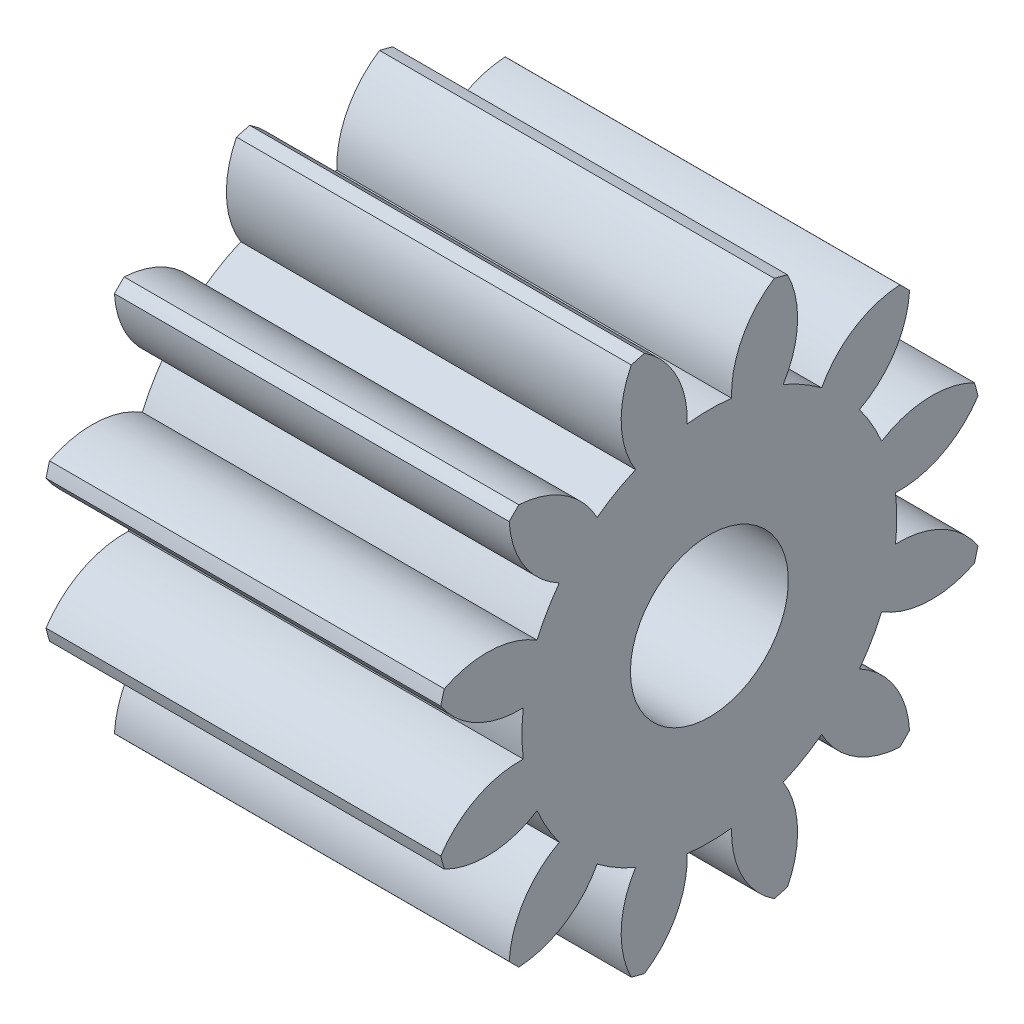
ISO-10303-21;
HEADER;
FILE_DESCRIPTION(('STEP AP214'),'2;1');
FILE_NAME('part.step','',(''),(''),'','','');
FILE_SCHEMA(('AUTOMOTIVE_DESIGN { 1 0 10303 214 1 1 1 1 }'));
ENDSEC;
DATA;
#1=APPLICATION_CONTEXT('core data for automotive mechanical design processes');
#2=APPLICATION_PROTOCOL_DEFINITION('international standard','automotive_design',2000,#1);
#3=PRODUCT_CONTEXT('',#1,'mechanical');
#4=PRODUCT('Part','Part','',(#3));
#5=PRODUCT_RELATED_PRODUCT_CATEGORY('part','',(#4));
#6=PRODUCT_DEFINITION_FORMATION('','',#4);
#7=PRODUCT_DEFINITION_CONTEXT('part definition',#1,'design');
#8=PRODUCT_DEFINITION('design','',#6,#7);
#9=PRODUCT_DEFINITION_SHAPE('','',#8);
#10=(LENGTH_UNIT() NAMED_UNIT(*) SI_UNIT(.MILLI.,.METRE.));
#11=(NAMED_UNIT(*) PLANE_ANGLE_UNIT() SI_UNIT($,.RADIAN.));
#12=(NAMED_UNIT(*) SI_UNIT($,.STERADIAN.) SOLID_ANGLE_UNIT());
#13=UNCERTAINTY_MEASURE_WITH_UNIT(LENGTH_MEASURE(1.E-05),#10,'distance_accuracy_value','');
#14=(GEOMETRIC_REPRESENTATION_CONTEXT(3) GLOBAL_UNCERTAINTY_ASSIGNED_CONTEXT((#13)) GLOBAL_UNIT_ASSIGNED_CONTEXT((#10,
#11,#12)) REPRESENTATION_CONTEXT('',''));
#15=CARTESIAN_POINT('',(0.,0.,0.));
#16=DIRECTION('',(0.,0.,1.));
#17=DIRECTION('',(1.,0.,0.));
#18=AXIS2_PLACEMENT_3D('',#15,#16,#17);
#19=CARTESIAN_POINT('',(5.,0.,0.));
#20=DIRECTION('',(-1.,0.,0.));
#21=DIRECTION('',(0.,0.,1.));
#22=AXIS2_PLACEMENT_3D('',#19,#20,#21);
#23=PLANE('',#22);
#24=CARTESIAN_POINT('',(5.,1.33747692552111,-2.4816034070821));
#25=DIRECTION('',(-1.,0.,0.));
#26=DIRECTION('',(0.,-0.499999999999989,-0.866025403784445));
#27=AXIS2_PLACEMENT_3D('',#24,#25,#26);
#28=CIRCLE('',#27,1.2);
#29=CARTESIAN_POINT('',(5.,1.90091808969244,-1.42210633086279));
#30=VERTEX_POINT('',#29);
#31=CARTESIAN_POINT('',(5.,2.53549858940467,-2.4127260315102));
#32=VERTEX_POINT('',#31);
#33=EDGE_CURVE('E348',#30,#32,#28,.T.);
#34=ORIENTED_EDGE('',*,*,#33,.F.);
#35=CARTESIAN_POINT('',(5.,0.,0.));
#36=DIRECTION('',(-1.,0.,0.));
#37=DIRECTION('',(0.,-0.499999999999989,-0.866025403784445));
#38=AXIS2_PLACEMENT_3D('',#35,#36,#37);
#39=CIRCLE('',#38,2.374);
#40=CARTESIAN_POINT('',(5.,2.1820392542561,-0.935190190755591));
#41=VERTEX_POINT('',#40);
#42=EDGE_CURVE('E615',#41,#30,#39,.T.);
#43=ORIENTED_EDGE('',*,*,#42,.F.);
#44=CARTESIAN_POINT('',(5.,2.81787005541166,0.0825127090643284));
#45=DIRECTION('',(-1.,0.,0.));
#46=DIRECTION('',(0.,-0.499999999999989,-0.866025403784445));
#47=AXIS2_PLACEMENT_3D('',#44,#45,#46);
#48=CIRCLE('',#47,1.2);
#49=CARTESIAN_POINT('',(5.,3.35723133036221,-0.98944317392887));
#50=VERTEX_POINT('',#49);
#51=EDGE_CURVE('E338',#50,#41,#48,.T.);
#52=ORIENTED_EDGE('',*,*,#51,.F.);
#53=CARTESIAN_POINT('',(5.,0.,0.));
#54=DIRECTION('',(-1.,0.,0.));
#55=DIRECTION('',(0.,0.,1.));
#56=AXIS2_PLACEMENT_3D('',#53,#54,#55);
#57=CIRCLE('',#56,3.5);
#58=CARTESIAN_POINT('',(5.,3.40216920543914,-0.821732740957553));
#59=VERTEX_POINT('',#58);
#60=EDGE_CURVE('E366',#59,#50,#57,.T.);
#61=ORIENTED_EDGE('',*,*,#60,.F.);
#62=CARTESIAN_POINT('',(5.,2.39909069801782,-1.48039312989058));
#63=DIRECTION('',(-1.,0.,0.));
#64=DIRECTION('',(0.,0.,-1.));
#65=AXIS2_PLACEMENT_3D('',#62,#63,#64);
#66=CIRCLE('',#65,1.2);
#67=CARTESIAN_POINT('',(5.,2.35729652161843,-0.281121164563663));
#68=VERTEX_POINT('',#67);
#69=EDGE_CURVE('E390',#68,#59,#66,.T.);
#70=ORIENTED_EDGE('',*,*,#69,.F.);
#71=CARTESIAN_POINT('',(5.,0.,0.));
#72=DIRECTION('',(-1.,0.,0.));
#73=DIRECTION('',(0.,0.,-1.));
#74=AXIS2_PLACEMENT_3D('',#71,#72,#73);
#75=CIRCLE('',#74,2.374);
#76=CARTESIAN_POINT('',(5.,2.35729652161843,0.281121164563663));
#77=VERTEX_POINT('',#76);
#78=EDGE_CURVE('E386',#77,#68,#75,.T.);
#79=ORIENTED_EDGE('',*,*,#78,.F.);
#80=CARTESIAN_POINT('',(5.,2.39909069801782,1.48039312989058));
#81=DIRECTION('',(-1.,0.,0.));
#82=DIRECTION('',(0.,0.,-1.));
#83=AXIS2_PLACEMENT_3D('',#80,#81,#82);
#84=CIRCLE('',#83,1.2);
#85=CARTESIAN_POINT('',(5.,3.40216920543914,0.821732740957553));
#86=VERTEX_POINT('',#85);
#87=EDGE_CURVE('E388',#86,#77,#84,.T.);
#88=ORIENTED_EDGE('',*,*,#87,.F.);
#89=CARTESIAN_POINT('',(5.,3.35723133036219,0.989443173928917));
#90=VERTEX_POINT('',#89);
#91=EDGE_CURVE('E360',#90,#86,#57,.T.);
#92=ORIENTED_EDGE('',*,*,#91,.F.);
#93=CARTESIAN_POINT('',(5.,2.81787005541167,-0.0825127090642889));
#94=DIRECTION('',(-1.,0.,0.));
#95=DIRECTION('',(0.,0.500000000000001,-0.866025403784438));
#96=AXIS2_PLACEMENT_3D('',#93,#94,#95);
#97=CIRCLE('',#96,1.2);
#98=CARTESIAN_POINT('',(5.,2.18203925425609,0.935190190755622));
#99=VERTEX_POINT('',#98);
#100=EDGE_CURVE('E409',#99,#90,#97,.T.);
#101=ORIENTED_EDGE('',*,*,#100,.F.);
#102=CARTESIAN_POINT('',(5.,0.,0.));
#103=DIRECTION('',(-1.,0.,0.));
#104=DIRECTION('',(0.,0.500000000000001,-0.866025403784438));
#105=AXIS2_PLACEMENT_3D('',#102,#103,#104);
#106=CIRCLE('',#105,2.374);
#107=CARTESIAN_POINT('',(5.,1.90091808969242,1.42210633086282));
#108=VERTEX_POINT('',#107);
#109=EDGE_CURVE('E405',#108,#99,#106,.T.);
#110=ORIENTED_EDGE('',*,*,#109,.F.);
#111=CARTESIAN_POINT('',(5.,1.33747692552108,2.48160340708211));
#112=DIRECTION('',(-1.,0.,0.));
#113=DIRECTION('',(0.,0.500000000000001,-0.866025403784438));
#114=AXIS2_PLACEMENT_3D('',#111,#112,#113);
#115=CIRCLE('',#114,1.2);
#116=CARTESIAN_POINT('',(5.,2.53549858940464,2.41272603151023));
#117=VERTEX_POINT('',#116);
#118=EDGE_CURVE('E407',#117,#108,#115,.T.);
#119=ORIENTED_EDGE('',*,*,#118,.F.);
#120=CARTESIAN_POINT('',(5.,2.41272603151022,2.53549858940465));
#121=VERTEX_POINT('',#120);
#122=EDGE_CURVE('E364',#121,#117,#57,.T.);
#123=ORIENTED_EDGE('',*,*,#122,.F.);
#124=CARTESIAN_POINT('',(5.,2.48160340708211,1.33747692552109));
#125=DIRECTION('',(-1.,0.,0.));
#126=DIRECTION('',(0.,0.86602540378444,-0.499999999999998));
#127=AXIS2_PLACEMENT_3D('',#124,#125,#126);
#128=CIRCLE('',#127,1.2);
#129=CARTESIAN_POINT('',(5.,1.42210633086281,1.90091808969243));
#130=VERTEX_POINT('',#129);
#131=EDGE_CURVE('E430',#130,#121,#128,.T.);
#132=ORIENTED_EDGE('',*,*,#131,.F.);
#133=CARTESIAN_POINT('',(5.,0.,0.));
#134=DIRECTION('',(-1.,0.,0.));
#135=DIRECTION('',(0.,0.86602540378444,-0.499999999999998));
#136=AXIS2_PLACEMENT_3D('',#133,#134,#135);
#137=CIRCLE('',#136,2.374);
#138=CARTESIAN_POINT('',(5.,0.935190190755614,2.18203925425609));
#139=VERTEX_POINT('',#138);
#140=EDGE_CURVE('E426',#139,#130,#137,.T.);
#141=ORIENTED_EDGE('',*,*,#140,.F.);
#142=CARTESIAN_POINT('',(5.,-0.0825127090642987,2.81787005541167));
#143=DIRECTION('',(-1.,0.,0.));
#144=DIRECTION('',(0.,0.86602540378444,-0.499999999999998));
#145=AXIS2_PLACEMENT_3D('',#142,#143,#144);
#146=CIRCLE('',#145,1.2);
#147=CARTESIAN_POINT('',(5.,0.989443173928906,3.3572313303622));
#148=VERTEX_POINT('',#147);
#149=EDGE_CURVE('E428',#148,#139,#146,.T.);
#150=ORIENTED_EDGE('',*,*,#149,.F.);
#151=CARTESIAN_POINT('',(5.,0.821732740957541,3.40216920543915));
#152=VERTEX_POINT('',#151);
#153=EDGE_CURVE('E745',#152,#148,#57,.T.);
#154=ORIENTED_EDGE('',*,*,#153,.F.);
#155=CARTESIAN_POINT('',(5.,1.48039312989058,2.39909069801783));
#156=DIRECTION('',(-1.,0.,0.));
#157=DIRECTION('',(0.,1.,0.));
#158=AXIS2_PLACEMENT_3D('',#155,#156,#157);
#159=CIRCLE('',#158,1.2);
#160=CARTESIAN_POINT('',(5.,0.281121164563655,2.35729652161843));
#161=VERTEX_POINT('',#160);
#162=EDGE_CURVE('E452',#161,#152,#159,.T.);
#163=ORIENTED_EDGE('',*,*,#162,.F.);
#164=CARTESIAN_POINT('',(5.,0.,0.));
#165=DIRECTION('',(-1.,0.,0.));
#166=DIRECTION('',(0.,1.,0.));
#167=AXIS2_PLACEMENT_3D('',#164,#165,#166);
#168=CIRCLE('',#167,2.374);
#169=CARTESIAN_POINT('',(5.,-0.281121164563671,2.35729652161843));
#170=VERTEX_POINT('',#169);
#171=EDGE_CURVE('E448',#170,#161,#168,.T.);
#172=ORIENTED_EDGE('',*,*,#171,.F.);
#173=CARTESIAN_POINT('',(5.,-1.48039312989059,2.39909069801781));
#174=DIRECTION('',(-1.,0.,0.));
#175=DIRECTION('',(0.,1.,0.));
#176=AXIS2_PLACEMENT_3D('',#173,#174,#175);
#177=CIRCLE('',#176,1.2);
#178=CARTESIAN_POINT('',(5.,-0.821732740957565,3.40216920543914));
#179=VERTEX_POINT('',#178);
#180=EDGE_CURVE('E450',#179,#170,#177,.T.);
#181=ORIENTED_EDGE('',*,*,#180,.F.);
#182=CARTESIAN_POINT('',(5.,-0.989443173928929,3.35723133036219));
#183=VERTEX_POINT('',#182);
#184=EDGE_CURVE('E740',#183,#179,#57,.T.);
#185=ORIENTED_EDGE('',*,*,#184,.F.);
#186=CARTESIAN_POINT('',(5.,0.0825127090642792,2.81787005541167));
#187=DIRECTION('',(-1.,0.,0.));
#188=DIRECTION('',(0.,0.866025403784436,0.500000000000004));
#189=AXIS2_PLACEMENT_3D('',#186,#187,#188);
#190=CIRCLE('',#189,1.2);
#191=CARTESIAN_POINT('',(5.,-0.93519019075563,2.18203925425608));
#192=VERTEX_POINT('',#191);
#193=EDGE_CURVE('E474',#192,#183,#190,.T.);
#194=ORIENTED_EDGE('',*,*,#193,.F.);
#195=CARTESIAN_POINT('',(5.,0.,0.));
#196=DIRECTION('',(-1.,0.,0.));
#197=DIRECTION('',(0.,0.866025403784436,0.500000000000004));
#198=AXIS2_PLACEMENT_3D('',#195,#196,#197);
#199=CIRCLE('',#198,2.374);
#200=CARTESIAN_POINT('',(5.,-1.42210633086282,1.90091808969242));
#201=VERTEX_POINT('',#200);
#202=EDGE_CURVE('E470',#201,#192,#199,.T.);
#203=ORIENTED_EDGE('',*,*,#202,.F.);
#204=CARTESIAN_POINT('',(5.,-2.48160340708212,1.33747692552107));
#205=DIRECTION('',(-1.,0.,0.));
#206=DIRECTION('',(0.,0.866025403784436,0.500000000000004));
#207=AXIS2_PLACEMENT_3D('',#204,#205,#206);
#208=CIRCLE('',#207,1.2);
#209=CARTESIAN_POINT('',(5.,-2.41272603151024,2.53549858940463));
#210=VERTEX_POINT('',#209);
#211=EDGE_CURVE('E472',#210,#201,#208,.T.);
#212=ORIENTED_EDGE('',*,*,#211,.F.);
#213=CARTESIAN_POINT('',(5.,-2.53549858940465,2.41272603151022));
#214=VERTEX_POINT('',#213);
#215=EDGE_CURVE('E735',#214,#210,#57,.T.);
#216=ORIENTED_EDGE('',*,*,#215,.F.);
#217=CARTESIAN_POINT('',(5.,-1.3374769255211,2.4816034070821));
#218=DIRECTION('',(-1.,0.,0.));
#219=DIRECTION('',(0.,0.499999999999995,0.866025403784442));
#220=AXIS2_PLACEMENT_3D('',#217,#218,#219);
#221=CIRCLE('',#220,1.2);
#222=CARTESIAN_POINT('',(5.,-1.90091808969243,1.4221063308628));
#223=VERTEX_POINT('',#222);
#224=EDGE_CURVE('E496',#223,#214,#221,.T.);
#225=ORIENTED_EDGE('',*,*,#224,.F.);
#226=CARTESIAN_POINT('',(5.,0.,0.));
#227=DIRECTION('',(-1.,0.,0.));
#228=DIRECTION('',(0.,0.499999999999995,0.866025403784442));
#229=AXIS2_PLACEMENT_3D('',#226,#227,#228);
#230=CIRCLE('',#229,2.374);
#231=CARTESIAN_POINT('',(5.,-2.18203925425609,0.935190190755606));
#232=VERTEX_POINT('',#231);
#233=EDGE_CURVE('E492',#232,#223,#230,.T.);
#234=ORIENTED_EDGE('',*,*,#233,.F.);
#235=CARTESIAN_POINT('',(5.,-2.81787005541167,-0.0825127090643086));
#236=DIRECTION('',(-1.,0.,0.));
#237=DIRECTION('',(0.,0.499999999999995,0.866025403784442));
#238=AXIS2_PLACEMENT_3D('',#235,#236,#237);
#239=CIRCLE('',#238,1.2);
#240=CARTESIAN_POINT('',(5.,-3.3572313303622,0.989443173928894));
#241=VERTEX_POINT('',#240);
#242=EDGE_CURVE('E494',#241,#232,#239,.T.);
#243=ORIENTED_EDGE('',*,*,#242,.F.);
#244=CARTESIAN_POINT('',(5.,-3.40216920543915,0.821732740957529));
#245=VERTEX_POINT('',#244);
#246=EDGE_CURVE('E730',#245,#241,#57,.T.);
#247=ORIENTED_EDGE('',*,*,#246,.F.);
#248=CARTESIAN_POINT('',(5.,-2.39909069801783,1.48039312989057));
#249=DIRECTION('',(-1.,0.,0.));
#250=DIRECTION('',(0.,0.,1.));
#251=AXIS2_PLACEMENT_3D('',#248,#249,#250);
#252=CIRCLE('',#251,1.2);
#253=CARTESIAN_POINT('',(5.,-2.35729652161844,0.281121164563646));
#254=VERTEX_POINT('',#253);
#255=EDGE_CURVE('E518',#254,#245,#252,.T.);
#256=ORIENTED_EDGE('',*,*,#255,.F.);
#257=CARTESIAN_POINT('',(5.,0.,0.));
#258=DIRECTION('',(-1.,0.,0.));
#259=DIRECTION('',(0.,0.,1.));
#260=AXIS2_PLACEMENT_3D('',#257,#258,#259);
#261=CIRCLE('',#260,2.374);
#262=CARTESIAN_POINT('',(5.,-2.35729652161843,-0.28112116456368));
#263=VERTEX_POINT('',#262);
#264=EDGE_CURVE('E514',#263,#254,#261,.T.);
#265=ORIENTED_EDGE('',*,*,#264,.F.);
#266=CARTESIAN_POINT('',(5.,-2.39909069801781,-1.4803931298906));
#267=DIRECTION('',(-1.,0.,0.));
#268=DIRECTION('',(0.,0.,1.));
#269=AXIS2_PLACEMENT_3D('',#266,#267,#268);
#270=CIRCLE('',#269,1.2);
#271=CARTESIAN_POINT('',(5.,-3.40216920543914,-0.821732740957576));
#272=VERTEX_POINT('',#271);
#273=EDGE_CURVE('E516',#272,#263,#270,.T.);
#274=ORIENTED_EDGE('',*,*,#273,.F.);
#275=CARTESIAN_POINT('',(5.,-3.35723133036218,-0.989443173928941));
#276=VERTEX_POINT('',#275);
#277=EDGE_CURVE('E725',#276,#272,#57,.T.);
#278=ORIENTED_EDGE('',*,*,#277,.F.);
#279=CARTESIAN_POINT('',(5.,-2.81787005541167,0.082512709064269));
#280=DIRECTION('',(-1.,0.,0.));
#281=DIRECTION('',(0.,-0.500000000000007,0.866025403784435));
#282=AXIS2_PLACEMENT_3D('',#279,#280,#281);
#283=CIRCLE('',#282,1.2);
#284=CARTESIAN_POINT('',(5.,-2.18203925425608,-0.935190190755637));
#285=VERTEX_POINT('',#284);
#286=EDGE_CURVE('E540',#285,#276,#283,.T.);
#287=ORIENTED_EDGE('',*,*,#286,.F.);
#288=CARTESIAN_POINT('',(5.,0.,0.));
#289=DIRECTION('',(-1.,0.,0.));
#290=DIRECTION('',(0.,-0.500000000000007,0.866025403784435));
#291=AXIS2_PLACEMENT_3D('',#288,#289,#290);
#292=CIRCLE('',#291,2.374);
#293=CARTESIAN_POINT('',(5.,-1.90091808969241,-1.42210633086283));
#294=VERTEX_POINT('',#293);
#295=EDGE_CURVE('E536',#294,#285,#292,.T.);
#296=ORIENTED_EDGE('',*,*,#295,.F.);
#297=CARTESIAN_POINT('',(5.,-1.33747692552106,-2.48160340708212));
#298=DIRECTION('',(-1.,0.,0.));
#299=DIRECTION('',(0.,-0.500000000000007,0.866025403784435));
#300=AXIS2_PLACEMENT_3D('',#297,#298,#299);
#301=CIRCLE('',#300,1.2);
#302=CARTESIAN_POINT('',(5.,-2.53549858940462,-2.41272603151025));
#303=VERTEX_POINT('',#302);
#304=EDGE_CURVE('E538',#303,#294,#301,.T.);
#305=ORIENTED_EDGE('',*,*,#304,.F.);
#306=CARTESIAN_POINT('',(5.,-2.41272603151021,-2.53549858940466));
#307=VERTEX_POINT('',#306);
#308=EDGE_CURVE('E720',#307,#303,#57,.T.);
#309=ORIENTED_EDGE('',*,*,#308,.F.);
#310=CARTESIAN_POINT('',(5.,-2.4816034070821,-1.3374769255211));
#311=DIRECTION('',(-1.,0.,0.));
#312=DIRECTION('',(0.,-0.866025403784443,0.499999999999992));
#313=AXIS2_PLACEMENT_3D('',#310,#311,#312);
#314=CIRCLE('',#313,1.2);
#315=CARTESIAN_POINT('',(5.,-1.4221063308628,-1.90091808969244));
#316=VERTEX_POINT('',#315);
#317=EDGE_CURVE('E562',#316,#307,#314,.T.);
#318=ORIENTED_EDGE('',*,*,#317,.F.);
#319=CARTESIAN_POINT('',(5.,0.,0.));
#320=DIRECTION('',(-1.,0.,0.));
#321=DIRECTION('',(0.,-0.866025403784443,0.499999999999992));
#322=AXIS2_PLACEMENT_3D('',#319,#320,#321);
#323=CIRCLE('',#322,2.374);
#324=CARTESIAN_POINT('',(5.,-0.935190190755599,-2.1820392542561));
#325=VERTEX_POINT('',#324);
#326=EDGE_CURVE('E558',#325,#316,#323,.T.);
#327=ORIENTED_EDGE('',*,*,#326,.F.);
#328=CARTESIAN_POINT('',(5.,0.0825127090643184,-2.81787005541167));
#329=DIRECTION('',(-1.,0.,0.));
#330=DIRECTION('',(0.,-0.866025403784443,0.499999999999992));
#331=AXIS2_PLACEMENT_3D('',#328,#329,#330);
#332=CIRCLE('',#331,1.2);
#333=CARTESIAN_POINT('',(5.,-0.989443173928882,-3.3572313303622));
#334=VERTEX_POINT('',#333);
#335=EDGE_CURVE('E560',#334,#325,#332,.T.);
#336=ORIENTED_EDGE('',*,*,#335,.F.);
#337=CARTESIAN_POINT('',(5.,-0.821732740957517,-3.40216920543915));
#338=VERTEX_POINT('',#337);
#339=EDGE_CURVE('E715',#338,#334,#57,.T.);
#340=ORIENTED_EDGE('',*,*,#339,.F.);
#341=CARTESIAN_POINT('',(5.,-1.48039312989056,-2.39909069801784));
#342=DIRECTION('',(-1.,0.,0.));
#343=DIRECTION('',(0.,-1.,0.));
#344=AXIS2_PLACEMENT_3D('',#341,#342,#343);
#345=CIRCLE('',#344,1.2);
#346=CARTESIAN_POINT('',(5.,-0.281121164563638,-2.35729652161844));
#347=VERTEX_POINT('',#346);
#348=EDGE_CURVE('E584',#347,#338,#345,.T.);
#349=ORIENTED_EDGE('',*,*,#348,.F.);
#350=CARTESIAN_POINT('',(5.,0.,0.));
#351=DIRECTION('',(-1.,0.,0.));
#352=DIRECTION('',(0.,-1.,0.));
#353=AXIS2_PLACEMENT_3D('',#350,#351,#352);
#354=CIRCLE('',#353,2.374);
#355=CARTESIAN_POINT('',(5.,0.281121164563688,-2.35729652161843));
#356=VERTEX_POINT('',#355);
#357=EDGE_CURVE('E580',#356,#347,#354,.T.);
#358=ORIENTED_EDGE('',*,*,#357,.F.);
#359=CARTESIAN_POINT('',(5.,1.48039312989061,-2.3990906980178));
#360=DIRECTION('',(-1.,0.,0.));
#361=DIRECTION('',(0.,-1.,0.));
#362=AXIS2_PLACEMENT_3D('',#359,#360,#361);
#363=CIRCLE('',#362,1.2);
#364=CARTESIAN_POINT('',(5.,0.821732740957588,-3.40216920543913));
#365=VERTEX_POINT('',#364);
#366=EDGE_CURVE('E582',#365,#356,#363,.T.);
#367=ORIENTED_EDGE('',*,*,#366,.F.);
#368=CARTESIAN_POINT('',(5.,0.989443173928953,-3.35723133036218));
#369=VERTEX_POINT('',#368);
#370=EDGE_CURVE('E714',#369,#365,#57,.T.);
#371=ORIENTED_EDGE('',*,*,#370,.F.);
#372=CARTESIAN_POINT('',(5.,-0.0825127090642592,-2.81787005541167));
#373=DIRECTION('',(-1.,0.,0.));
#374=DIRECTION('',(0.,-0.866025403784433,-0.50000000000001));
#375=AXIS2_PLACEMENT_3D('',#372,#373,#374);
#376=CIRCLE('',#375,1.2);
#377=CARTESIAN_POINT('',(5.,0.935190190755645,-2.18203925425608));
#378=VERTEX_POINT('',#377);
#379=EDGE_CURVE('E605',#378,#369,#376,.T.);
#380=ORIENTED_EDGE('',*,*,#379,.F.);
#381=CARTESIAN_POINT('',(5.,0.,0.));
#382=DIRECTION('',(-1.,0.,0.));
#383=DIRECTION('',(0.,-0.866025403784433,-0.50000000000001));
#384=AXIS2_PLACEMENT_3D('',#381,#382,#383);
#385=CIRCLE('',#384,2.374);
#386=CARTESIAN_POINT('',(5.,1.42210633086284,-1.90091808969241));
#387=VERTEX_POINT('',#386);
#388=EDGE_CURVE('E601',#387,#378,#385,.T.);
#389=ORIENTED_EDGE('',*,*,#388,.F.);
#390=CARTESIAN_POINT('',(5.,2.48160340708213,-1.33747692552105));
#391=DIRECTION('',(-1.,0.,0.));
#392=DIRECTION('',(0.,-0.866025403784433,-0.50000000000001));
#393=AXIS2_PLACEMENT_3D('',#390,#391,#392);
#394=CIRCLE('',#393,1.2);
#395=CARTESIAN_POINT('',(5.,2.41272603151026,-2.53549858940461));
#396=VERTEX_POINT('',#395);
#397=EDGE_CURVE('E603',#396,#387,#394,.T.);
#398=ORIENTED_EDGE('',*,*,#397,.F.);
#399=EDGE_CURVE('E678',#32,#396,#57,.T.);
#400=ORIENTED_EDGE('',*,*,#399,.F.);
#401=EDGE_LOOP('',(#34,#43,#52,#61,#70,#79,#88,#92,#101,#110,#119,#123,#132,#141,#150,#154,#163,
#172,#181,#185,#194,#203,#212,#216,#225,#234,#243,#247,#256,#265,#274,#278,#287,#296,#305,#309,
#318,#327,#336,#340,#349,#358,#367,#371,#380,#389,#398,#400));
#402=FACE_BOUND('',#401,.T.);
#403=CARTESIAN_POINT('',(5.,0.,0.));
#404=DIRECTION('',(-1.,0.,0.));
#405=DIRECTION('',(0.,0.,1.));
#406=AXIS2_PLACEMENT_3D('',#403,#404,#405);
#407=CIRCLE('',#406,0.999999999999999);
#408=CARTESIAN_POINT('',(5.,0.,0.999999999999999));
#409=VERTEX_POINT('',#408);
#410=EDGE_CURVE('E620',#409,#409,#407,.F.);
#411=ORIENTED_EDGE('',*,*,#410,.F.);
#412=EDGE_LOOP('',(#411));
#413=FACE_BOUND('',#412,.T.);
#414=ADVANCED_FACE('F27',(#402,#413),#23,.F.);
#415=CARTESIAN_POINT('',(0.,0.,0.));
#416=DIRECTION('',(1.,0.,0.));
#417=DIRECTION('',(0.,0.,-1.));
#418=AXIS2_PLACEMENT_3D('',#415,#416,#417);
#419=PLANE('',#418);
#420=CARTESIAN_POINT('',(0.,1.33747692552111,-2.4816034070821));
#421=DIRECTION('',(-1.,0.,0.));
#422=DIRECTION('',(0.,-0.499999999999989,-0.866025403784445));
#423=AXIS2_PLACEMENT_3D('',#420,#421,#422);
#424=CIRCLE('',#423,1.2);
#425=CARTESIAN_POINT('',(0.,1.90091808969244,-1.42210633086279));
#426=VERTEX_POINT('',#425);
#427=CARTESIAN_POINT('',(0.,2.53549858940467,-2.4127260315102));
#428=VERTEX_POINT('',#427);
#429=EDGE_CURVE('E42',#426,#428,#424,.T.);
#430=ORIENTED_EDGE('',*,*,#429,.T.);
#431=CARTESIAN_POINT('',(0.,0.,0.));
#432=DIRECTION('',(-1.,0.,0.));
#433=DIRECTION('',(0.,0.,1.));
#434=AXIS2_PLACEMENT_3D('',#431,#432,#433);
#435=CIRCLE('',#434,3.5);
#436=CARTESIAN_POINT('',(0.,2.41272603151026,-2.53549858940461));
#437=VERTEX_POINT('',#436);
#438=EDGE_CURVE('E361',#428,#437,#435,.T.);
#439=ORIENTED_EDGE('',*,*,#438,.T.);
#440=CARTESIAN_POINT('',(0.,2.48160340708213,-1.33747692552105));
#441=DIRECTION('',(1.,0.,0.));
#442=DIRECTION('',(0.,0.,-1.));
#443=AXIS2_PLACEMENT_3D('',#440,#441,#442);
#444=CIRCLE('',#443,1.2);
#445=CARTESIAN_POINT('',(0.,1.42210633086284,-1.90091808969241));
#446=VERTEX_POINT('',#445);
#447=EDGE_CURVE('E35',#446,#437,#444,.T.);
#448=ORIENTED_EDGE('',*,*,#447,.F.);
#449=CARTESIAN_POINT('',(0.,0.,0.));
#450=DIRECTION('',(-1.,0.,0.));
#451=DIRECTION('',(0.,-0.866025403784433,-0.50000000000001));
#452=AXIS2_PLACEMENT_3D('',#449,#450,#451);
#453=CIRCLE('',#452,2.374);
#454=CARTESIAN_POINT('',(0.,0.935190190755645,-2.18203925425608));
#455=VERTEX_POINT('',#454);
#456=EDGE_CURVE('E607',#446,#455,#453,.T.);
#457=ORIENTED_EDGE('',*,*,#456,.T.);
#458=CARTESIAN_POINT('',(0.,-0.0825127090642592,-2.81787005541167));
#459=DIRECTION('',(-1.,0.,0.));
#460=DIRECTION('',(0.,-0.866025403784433,-0.50000000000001));
#461=AXIS2_PLACEMENT_3D('',#458,#459,#460);
#462=CIRCLE('',#461,1.2);
#463=CARTESIAN_POINT('',(0.,0.989443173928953,-3.35723133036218));
#464=VERTEX_POINT('',#463);
#465=EDGE_CURVE('E50',#455,#464,#462,.T.);
#466=ORIENTED_EDGE('',*,*,#465,.T.);
#467=CARTESIAN_POINT('',(0.,0.821732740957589,-3.40216920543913));
#468=VERTEX_POINT('',#467);
#469=EDGE_CURVE('E367',#464,#468,#435,.T.);
#470=ORIENTED_EDGE('',*,*,#469,.T.);
#471=CARTESIAN_POINT('',(0.,1.48039312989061,-2.3990906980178));
#472=DIRECTION('',(1.,0.,0.));
#473=DIRECTION('',(0.,0.,-1.));
#474=AXIS2_PLACEMENT_3D('',#471,#472,#473);
#475=CIRCLE('',#474,1.2);
#476=CARTESIAN_POINT('',(0.,0.281121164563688,-2.35729652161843));
#477=VERTEX_POINT('',#476);
#478=EDGE_CURVE('E700',#477,#468,#475,.T.);
#479=ORIENTED_EDGE('',*,*,#478,.F.);
#480=CARTESIAN_POINT('',(0.,0.,0.));
#481=DIRECTION('',(-1.,0.,0.));
#482=DIRECTION('',(0.,-1.,0.));
#483=AXIS2_PLACEMENT_3D('',#480,#481,#482);
#484=CIRCLE('',#483,2.374);
#485=CARTESIAN_POINT('',(0.,-0.281121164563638,-2.35729652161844));
#486=VERTEX_POINT('',#485);
#487=EDGE_CURVE('E586',#477,#486,#484,.T.);
#488=ORIENTED_EDGE('',*,*,#487,.T.);
#489=CARTESIAN_POINT('',(0.,-1.48039312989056,-2.39909069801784));
#490=DIRECTION('',(-1.,0.,0.));
#491=DIRECTION('',(0.,-1.,0.));
#492=AXIS2_PLACEMENT_3D('',#489,#490,#491);
#493=CIRCLE('',#492,1.2);
#494=CARTESIAN_POINT('',(0.,-0.821732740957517,-3.40216920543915));
#495=VERTEX_POINT('',#494);
#496=EDGE_CURVE('E589',#486,#495,#493,.T.);
#497=ORIENTED_EDGE('',*,*,#496,.T.);
#498=CARTESIAN_POINT('',(0.,-0.989443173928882,-3.3572313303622));
#499=VERTEX_POINT('',#498);
#500=EDGE_CURVE('E796',#495,#499,#435,.T.);
#501=ORIENTED_EDGE('',*,*,#500,.T.);
#502=CARTESIAN_POINT('',(0.,0.0825127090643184,-2.81787005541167));
#503=DIRECTION('',(1.,0.,0.));
#504=DIRECTION('',(0.,0.,-1.));
#505=AXIS2_PLACEMENT_3D('',#502,#503,#504);
#506=CIRCLE('',#505,1.2);
#507=CARTESIAN_POINT('',(0.,-0.935190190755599,-2.1820392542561));
#508=VERTEX_POINT('',#507);
#509=EDGE_CURVE('E697',#508,#499,#506,.T.);
#510=ORIENTED_EDGE('',*,*,#509,.F.);
#511=CARTESIAN_POINT('',(0.,0.,0.));
#512=DIRECTION('',(-1.,0.,0.));
#513=DIRECTION('',(0.,-0.866025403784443,0.499999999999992));
#514=AXIS2_PLACEMENT_3D('',#511,#512,#513);
#515=CIRCLE('',#514,2.374);
#516=CARTESIAN_POINT('',(0.,-1.4221063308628,-1.90091808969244));
#517=VERTEX_POINT('',#516);
#518=EDGE_CURVE('E564',#508,#517,#515,.T.);
#519=ORIENTED_EDGE('',*,*,#518,.T.);
#520=CARTESIAN_POINT('',(0.,-2.4816034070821,-1.3374769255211));
#521=DIRECTION('',(-1.,0.,0.));
#522=DIRECTION('',(0.,-0.866025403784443,0.499999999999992));
#523=AXIS2_PLACEMENT_3D('',#520,#521,#522);
#524=CIRCLE('',#523,1.2);
#525=CARTESIAN_POINT('',(0.,-2.41272603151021,-2.53549858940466));
#526=VERTEX_POINT('',#525);
#527=EDGE_CURVE('E567',#517,#526,#524,.T.);
#528=ORIENTED_EDGE('',*,*,#527,.T.);
#529=CARTESIAN_POINT('',(0.,-2.53549858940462,-2.41272603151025));
#530=VERTEX_POINT('',#529);
#531=EDGE_CURVE('E793',#526,#530,#435,.T.);
#532=ORIENTED_EDGE('',*,*,#531,.T.);
#533=CARTESIAN_POINT('',(0.,-1.33747692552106,-2.48160340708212));
#534=DIRECTION('',(1.,0.,0.));
#535=DIRECTION('',(0.,0.,-1.));
#536=AXIS2_PLACEMENT_3D('',#533,#534,#535);
#537=CIRCLE('',#536,1.2);
#538=CARTESIAN_POINT('',(0.,-1.90091808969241,-1.42210633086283));
#539=VERTEX_POINT('',#538);
#540=EDGE_CURVE('E694',#539,#530,#537,.T.);
#541=ORIENTED_EDGE('',*,*,#540,.F.);
#542=CARTESIAN_POINT('',(0.,0.,0.));
#543=DIRECTION('',(-1.,0.,0.));
#544=DIRECTION('',(0.,-0.500000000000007,0.866025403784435));
#545=AXIS2_PLACEMENT_3D('',#542,#543,#544);
#546=CIRCLE('',#545,2.374);
#547=CARTESIAN_POINT('',(0.,-2.18203925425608,-0.935190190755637));
#548=VERTEX_POINT('',#547);
#549=EDGE_CURVE('E542',#539,#548,#546,.T.);
#550=ORIENTED_EDGE('',*,*,#549,.T.);
#551=CARTESIAN_POINT('',(0.,-2.81787005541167,0.082512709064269));
#552=DIRECTION('',(-1.,0.,0.));
#553=DIRECTION('',(0.,-0.500000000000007,0.866025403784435));
#554=AXIS2_PLACEMENT_3D('',#551,#552,#553);
#555=CIRCLE('',#554,1.2);
#556=CARTESIAN_POINT('',(0.,-3.35723133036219,-0.989443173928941));
#557=VERTEX_POINT('',#556);
#558=EDGE_CURVE('E545',#548,#557,#555,.T.);
#559=ORIENTED_EDGE('',*,*,#558,.T.);
#560=CARTESIAN_POINT('',(0.,-3.40216920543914,-0.821732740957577));
#561=VERTEX_POINT('',#560);
#562=EDGE_CURVE('E790',#557,#561,#435,.T.);
#563=ORIENTED_EDGE('',*,*,#562,.T.);
#564=CARTESIAN_POINT('',(0.,-2.39909069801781,-1.4803931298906));
#565=DIRECTION('',(1.,0.,0.));
#566=DIRECTION('',(0.,0.,-1.));
#567=AXIS2_PLACEMENT_3D('',#564,#565,#566);
#568=CIRCLE('',#567,1.2);
#569=CARTESIAN_POINT('',(0.,-2.35729652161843,-0.28112116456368));
#570=VERTEX_POINT('',#569);
#571=EDGE_CURVE('E691',#570,#561,#568,.T.);
#572=ORIENTED_EDGE('',*,*,#571,.F.);
#573=CARTESIAN_POINT('',(0.,0.,0.));
#574=DIRECTION('',(-1.,0.,0.));
#575=DIRECTION('',(0.,0.,1.));
#576=AXIS2_PLACEMENT_3D('',#573,#574,#575);
#577=CIRCLE('',#576,2.374);
#578=CARTESIAN_POINT('',(0.,-2.35729652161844,0.281121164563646));
#579=VERTEX_POINT('',#578);
#580=EDGE_CURVE('E520',#570,#579,#577,.T.);
#581=ORIENTED_EDGE('',*,*,#580,.T.);
#582=CARTESIAN_POINT('',(0.,-2.39909069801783,1.48039312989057));
#583=DIRECTION('',(-1.,0.,0.));
#584=DIRECTION('',(0.,0.,1.));
#585=AXIS2_PLACEMENT_3D('',#582,#583,#584);
#586=CIRCLE('',#585,1.2);
#587=CARTESIAN_POINT('',(0.,-3.40216920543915,0.821732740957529));
#588=VERTEX_POINT('',#587);
#589=EDGE_CURVE('E523',#579,#588,#586,.T.);
#590=ORIENTED_EDGE('',*,*,#589,.T.);
#591=CARTESIAN_POINT('',(0.,-3.3572313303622,0.989443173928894));
#592=VERTEX_POINT('',#591);
#593=EDGE_CURVE('E787',#588,#592,#435,.T.);
#594=ORIENTED_EDGE('',*,*,#593,.T.);
#595=CARTESIAN_POINT('',(0.,-2.81787005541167,-0.0825127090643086));
#596=DIRECTION('',(1.,0.,0.));
#597=DIRECTION('',(0.,0.,-1.));
#598=AXIS2_PLACEMENT_3D('',#595,#596,#597);
#599=CIRCLE('',#598,1.2);
#600=CARTESIAN_POINT('',(0.,-2.18203925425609,0.935190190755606));
#601=VERTEX_POINT('',#600);
#602=EDGE_CURVE('E688',#601,#592,#599,.T.);
#603=ORIENTED_EDGE('',*,*,#602,.F.);
#604=CARTESIAN_POINT('',(0.,0.,0.));
#605=DIRECTION('',(-1.,0.,0.));
#606=DIRECTION('',(0.,0.499999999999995,0.866025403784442));
#607=AXIS2_PLACEMENT_3D('',#604,#605,#606);
#608=CIRCLE('',#607,2.374);
#609=CARTESIAN_POINT('',(0.,-1.90091808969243,1.4221063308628));
#610=VERTEX_POINT('',#609);
#611=EDGE_CURVE('E498',#601,#610,#608,.T.);
#612=ORIENTED_EDGE('',*,*,#611,.T.);
#613=CARTESIAN_POINT('',(0.,-1.3374769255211,2.4816034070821));
#614=DIRECTION('',(-1.,0.,0.));
#615=DIRECTION('',(0.,0.499999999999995,0.866025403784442));
#616=AXIS2_PLACEMENT_3D('',#613,#614,#615);
#617=CIRCLE('',#616,1.2);
#618=CARTESIAN_POINT('',(0.,-2.53549858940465,2.41272603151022));
#619=VERTEX_POINT('',#618);
#620=EDGE_CURVE('E501',#610,#619,#617,.T.);
#621=ORIENTED_EDGE('',*,*,#620,.T.);
#622=CARTESIAN_POINT('',(0.,-2.41272603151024,2.53549858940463));
#623=VERTEX_POINT('',#622);
#624=EDGE_CURVE('E784',#619,#623,#435,.T.);
#625=ORIENTED_EDGE('',*,*,#624,.T.);
#626=CARTESIAN_POINT('',(0.,-2.48160340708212,1.33747692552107));
#627=DIRECTION('',(1.,0.,0.));
#628=DIRECTION('',(0.,0.,-1.));
#629=AXIS2_PLACEMENT_3D('',#626,#627,#628);
#630=CIRCLE('',#629,1.2);
#631=CARTESIAN_POINT('',(0.,-1.42210633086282,1.90091808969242));
#632=VERTEX_POINT('',#631);
#633=EDGE_CURVE('E685',#632,#623,#630,.T.);
#634=ORIENTED_EDGE('',*,*,#633,.F.);
#635=CARTESIAN_POINT('',(0.,0.,0.));
#636=DIRECTION('',(-1.,0.,0.));
#637=DIRECTION('',(0.,0.866025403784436,0.500000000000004));
#638=AXIS2_PLACEMENT_3D('',#635,#636,#637);
#639=CIRCLE('',#638,2.374);
#640=CARTESIAN_POINT('',(0.,-0.935190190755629,2.18203925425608));
#641=VERTEX_POINT('',#640);
#642=EDGE_CURVE('E476',#632,#641,#639,.T.);
#643=ORIENTED_EDGE('',*,*,#642,.T.);
#644=CARTESIAN_POINT('',(0.,0.0825127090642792,2.81787005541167));
#645=DIRECTION('',(-1.,0.,0.));
#646=DIRECTION('',(0.,0.866025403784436,0.500000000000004));
#647=AXIS2_PLACEMENT_3D('',#644,#645,#646);
#648=CIRCLE('',#647,1.2);
#649=CARTESIAN_POINT('',(0.,-0.98944317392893,3.35723133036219));
#650=VERTEX_POINT('',#649);
#651=EDGE_CURVE('E479',#641,#650,#648,.T.);
#652=ORIENTED_EDGE('',*,*,#651,.T.);
#653=CARTESIAN_POINT('',(0.,-0.821732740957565,3.40216920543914));
#654=VERTEX_POINT('',#653);
#655=EDGE_CURVE('E783',#650,#654,#435,.T.);
#656=ORIENTED_EDGE('',*,*,#655,.T.);
#657=CARTESIAN_POINT('',(0.,-1.48039312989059,2.39909069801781));
#658=DIRECTION('',(1.,0.,0.));
#659=DIRECTION('',(0.,0.,-1.));
#660=AXIS2_PLACEMENT_3D('',#657,#658,#659);
#661=CIRCLE('',#660,1.2);
#662=CARTESIAN_POINT('',(0.,-0.281121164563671,2.35729652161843));
#663=VERTEX_POINT('',#662);
#664=EDGE_CURVE('E682',#663,#654,#661,.T.);
#665=ORIENTED_EDGE('',*,*,#664,.F.);
#666=CARTESIAN_POINT('',(0.,0.,0.));
#667=DIRECTION('',(-1.,0.,0.));
#668=DIRECTION('',(0.,1.,0.));
#669=AXIS2_PLACEMENT_3D('',#666,#667,#668);
#670=CIRCLE('',#669,2.374);
#671=CARTESIAN_POINT('',(0.,0.281121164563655,2.35729652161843));
#672=VERTEX_POINT('',#671);
#673=EDGE_CURVE('E454',#663,#672,#670,.T.);
#674=ORIENTED_EDGE('',*,*,#673,.T.);
#675=CARTESIAN_POINT('',(0.,1.48039312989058,2.39909069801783));
#676=DIRECTION('',(-1.,0.,0.));
#677=DIRECTION('',(0.,1.,0.));
#678=AXIS2_PLACEMENT_3D('',#675,#676,#677);
#679=CIRCLE('',#678,1.2);
#680=CARTESIAN_POINT('',(0.,0.821732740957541,3.40216920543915));
#681=VERTEX_POINT('',#680);
#682=EDGE_CURVE('E457',#672,#681,#679,.T.);
#683=ORIENTED_EDGE('',*,*,#682,.T.);
#684=CARTESIAN_POINT('',(0.,0.989443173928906,3.3572313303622));
#685=VERTEX_POINT('',#684);
#686=EDGE_CURVE('E375',#681,#685,#435,.T.);
#687=ORIENTED_EDGE('',*,*,#686,.T.);
#688=CARTESIAN_POINT('',(0.,-0.0825127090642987,2.81787005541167));
#689=DIRECTION('',(1.,0.,0.));
#690=DIRECTION('',(0.,0.,-1.));
#691=AXIS2_PLACEMENT_3D('',#688,#689,#690);
#692=CIRCLE('',#691,1.2);
#693=CARTESIAN_POINT('',(0.,0.935190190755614,2.18203925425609));
#694=VERTEX_POINT('',#693);
#695=EDGE_CURVE('E675',#694,#685,#692,.T.);
#696=ORIENTED_EDGE('',*,*,#695,.F.);
#697=CARTESIAN_POINT('',(0.,0.,0.));
#698=DIRECTION('',(-1.,0.,0.));
#699=DIRECTION('',(0.,0.86602540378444,-0.499999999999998));
#700=AXIS2_PLACEMENT_3D('',#697,#698,#699);
#701=CIRCLE('',#700,2.374);
#702=CARTESIAN_POINT('',(0.,1.42210633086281,1.90091808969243));
#703=VERTEX_POINT('',#702);
#704=EDGE_CURVE('E432',#694,#703,#701,.T.);
#705=ORIENTED_EDGE('',*,*,#704,.T.);
#706=CARTESIAN_POINT('',(0.,2.48160340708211,1.33747692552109));
#707=DIRECTION('',(-1.,0.,0.));
#708=DIRECTION('',(0.,0.86602540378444,-0.499999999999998));
#709=AXIS2_PLACEMENT_3D('',#706,#707,#708);
#710=CIRCLE('',#709,1.2);
#711=CARTESIAN_POINT('',(0.,2.41272603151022,2.53549858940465));
#712=VERTEX_POINT('',#711);
#713=EDGE_CURVE('E435',#703,#712,#710,.T.);
#714=ORIENTED_EDGE('',*,*,#713,.T.);
#715=CARTESIAN_POINT('',(0.,2.53549858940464,2.41272603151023));
#716=VERTEX_POINT('',#715);
#717=EDGE_CURVE('E369',#712,#716,#435,.T.);
#718=ORIENTED_EDGE('',*,*,#717,.T.);
#719=CARTESIAN_POINT('',(0.,1.33747692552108,2.48160340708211));
#720=DIRECTION('',(1.,0.,0.));
#721=DIRECTION('',(0.,0.,-1.));
#722=AXIS2_PLACEMENT_3D('',#719,#720,#721);
#723=CIRCLE('',#722,1.2);
#724=CARTESIAN_POINT('',(0.,1.90091808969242,1.42210633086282));
#725=VERTEX_POINT('',#724);
#726=EDGE_CURVE('E672',#725,#716,#723,.T.);
#727=ORIENTED_EDGE('',*,*,#726,.F.);
#728=CARTESIAN_POINT('',(0.,0.,0.));
#729=DIRECTION('',(-1.,0.,0.));
#730=DIRECTION('',(0.,0.500000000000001,-0.866025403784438));
#731=AXIS2_PLACEMENT_3D('',#728,#729,#730);
#732=CIRCLE('',#731,2.374);
#733=CARTESIAN_POINT('',(0.,2.18203925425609,0.935190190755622));
#734=VERTEX_POINT('',#733);
#735=EDGE_CURVE('E411',#725,#734,#732,.T.);
#736=ORIENTED_EDGE('',*,*,#735,.T.);
#737=CARTESIAN_POINT('',(0.,2.81787005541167,-0.0825127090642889));
#738=DIRECTION('',(-1.,0.,0.));
#739=DIRECTION('',(0.,0.500000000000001,-0.866025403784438));
#740=AXIS2_PLACEMENT_3D('',#737,#738,#739);
#741=CIRCLE('',#740,1.2);
#742=CARTESIAN_POINT('',(0.,3.35723133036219,0.989443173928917));
#743=VERTEX_POINT('',#742);
#744=EDGE_CURVE('E414',#734,#743,#741,.T.);
#745=ORIENTED_EDGE('',*,*,#744,.T.);
#746=CARTESIAN_POINT('',(0.,3.40216920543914,0.821732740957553));
#747=VERTEX_POINT('',#746);
#748=EDGE_CURVE('E363',#743,#747,#435,.T.);
#749=ORIENTED_EDGE('',*,*,#748,.T.);
#750=CARTESIAN_POINT('',(0.,2.39909069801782,1.48039312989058));
#751=DIRECTION('',(1.,0.,0.));
#752=DIRECTION('',(0.,0.,-1.));
#753=AXIS2_PLACEMENT_3D('',#750,#751,#752);
#754=CIRCLE('',#753,1.2);
#755=CARTESIAN_POINT('',(0.,2.35729652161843,0.281121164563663));
#756=VERTEX_POINT('',#755);
#757=EDGE_CURVE('E671',#756,#747,#754,.T.);
#758=ORIENTED_EDGE('',*,*,#757,.F.);
#759=CARTESIAN_POINT('',(0.,0.,0.));
#760=DIRECTION('',(-1.,0.,0.));
#761=DIRECTION('',(0.,0.,-1.));
#762=AXIS2_PLACEMENT_3D('',#759,#760,#761);
#763=CIRCLE('',#762,2.374);
#764=CARTESIAN_POINT('',(0.,2.35729652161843,-0.281121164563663));
#765=VERTEX_POINT('',#764);
#766=EDGE_CURVE('E392',#756,#765,#763,.T.);
#767=ORIENTED_EDGE('',*,*,#766,.T.);
#768=CARTESIAN_POINT('',(0.,2.39909069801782,-1.48039312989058));
#769=DIRECTION('',(-1.,0.,0.));
#770=DIRECTION('',(0.,0.,-1.));
#771=AXIS2_PLACEMENT_3D('',#768,#769,#770);
#772=CIRCLE('',#771,1.2);
#773=CARTESIAN_POINT('',(0.,3.40216920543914,-0.821732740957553));
#774=VERTEX_POINT('',#773);
#775=EDGE_CURVE('E357',#765,#774,#772,.T.);
#776=ORIENTED_EDGE('',*,*,#775,.T.);
#777=CARTESIAN_POINT('',(0.,3.35723133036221,-0.98944317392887));
#778=VERTEX_POINT('',#777);
#779=EDGE_CURVE('E355',#774,#778,#435,.T.);
#780=ORIENTED_EDGE('',*,*,#779,.T.);
#781=CARTESIAN_POINT('',(0.,2.81787005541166,0.0825127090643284));
#782=DIRECTION('',(1.,0.,0.));
#783=DIRECTION('',(0.,0.,-1.));
#784=AXIS2_PLACEMENT_3D('',#781,#782,#783);
#785=CIRCLE('',#784,1.2);
#786=CARTESIAN_POINT('',(0.,2.1820392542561,-0.935190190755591));
#787=VERTEX_POINT('',#786);
#788=EDGE_CURVE('E11',#787,#778,#785,.T.);
#789=ORIENTED_EDGE('',*,*,#788,.F.);
#790=CARTESIAN_POINT('',(0.,0.,0.));
#791=DIRECTION('',(-1.,0.,0.));
#792=DIRECTION('',(0.,-0.499999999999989,-0.866025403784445));
#793=AXIS2_PLACEMENT_3D('',#790,#791,#792);
#794=CIRCLE('',#793,2.374);
#795=EDGE_CURVE('E345',#787,#426,#794,.T.);
#796=ORIENTED_EDGE('',*,*,#795,.T.);
#797=EDGE_LOOP('',(#430,#439,#448,#457,#466,#470,#479,#488,#497,#501,#510,#519,#528,#532,#541,
#550,#559,#563,#572,#581,#590,#594,#603,#612,#621,#625,#634,#643,#652,#656,#665,#674,#683,#687,
#696,#705,#714,#718,#727,#736,#745,#749,#758,#767,#776,#780,#789,#796));
#798=FACE_BOUND('',#797,.T.);
#799=CARTESIAN_POINT('',(0.,0.,0.));
#800=DIRECTION('',(1.,0.,0.));
#801=DIRECTION('',(0.,0.,-1.));
#802=AXIS2_PLACEMENT_3D('',#799,#800,#801);
#803=CIRCLE('',#802,0.999999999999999);
#804=CARTESIAN_POINT('',(0.,0.,-0.999999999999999));
#805=VERTEX_POINT('',#804);
#806=EDGE_CURVE('E30',#805,#805,#803,.F.);
#807=ORIENTED_EDGE('',*,*,#806,.F.);
#808=EDGE_LOOP('',(#807));
#809=FACE_BOUND('',#808,.T.);
#810=ADVANCED_FACE('F351',(#798,#809),#419,.F.);
#811=CARTESIAN_POINT('',(-10.,0.,0.));
#812=DIRECTION('',(-1.,0.,0.));
#813=DIRECTION('',(0.,0.,1.));
#814=AXIS2_PLACEMENT_3D('',#811,#812,#813);
#815=CYLINDRICAL_SURFACE('',#814,3.5);
#816=DIRECTION('',(-1.,0.,0.));
#817=VECTOR('',#816,1.);
#818=CARTESIAN_POINT('',(2.5,2.53549858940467,-2.4127260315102));
#819=LINE('',#818,#817);
#820=EDGE_CURVE('E611',#32,#428,#819,.T.);
#821=ORIENTED_EDGE('',*,*,#820,.F.);
#822=ORIENTED_EDGE('',*,*,#399,.T.);
#823=DIRECTION('',(-1.,0.,0.));
#824=VECTOR('',#823,1.);
#825=CARTESIAN_POINT('',(2.5,2.41272603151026,-2.53549858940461));
#826=LINE('',#825,#824);
#827=EDGE_CURVE('E594',#437,#396,#826,.F.);
#828=ORIENTED_EDGE('',*,*,#827,.F.);
#829=ORIENTED_EDGE('',*,*,#438,.F.);
#830=EDGE_LOOP('',(#821,#822,#828,#829));
#831=FACE_BOUND('',#830,.T.);
#832=ADVANCED_FACE('F629',(#831),#815,.T.);
#833=DIRECTION('',(-1.,0.,0.));
#834=VECTOR('',#833,1.);
#835=CARTESIAN_POINT('',(2.5,3.35723133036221,-0.98944317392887));
#836=LINE('',#835,#834);
#837=EDGE_CURVE('E341',#778,#50,#836,.F.);
#838=ORIENTED_EDGE('',*,*,#837,.F.);
#839=ORIENTED_EDGE('',*,*,#779,.F.);
#840=DIRECTION('',(-1.,0.,0.));
#841=VECTOR('',#840,1.);
#842=CARTESIAN_POINT('',(2.5,3.40216920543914,-0.821732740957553));
#843=LINE('',#842,#841);
#844=EDGE_CURVE('E370',#59,#774,#843,.T.);
#845=ORIENTED_EDGE('',*,*,#844,.F.);
#846=ORIENTED_EDGE('',*,*,#60,.T.);
#847=EDGE_LOOP('',(#838,#839,#845,#846));
#848=FACE_BOUND('',#847,.T.);
#849=ADVANCED_FACE('F636',(#848),#815,.T.);
#850=DIRECTION('',(-1.,0.,0.));
#851=VECTOR('',#850,1.);
#852=CARTESIAN_POINT('',(2.5,0.989443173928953,-3.35723133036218));
#853=LINE('',#852,#851);
#854=EDGE_CURVE('E592',#369,#464,#853,.T.);
#855=ORIENTED_EDGE('',*,*,#854,.F.);
#856=ORIENTED_EDGE('',*,*,#370,.T.);
#857=DIRECTION('',(-1.,0.,0.));
#858=VECTOR('',#857,1.);
#859=CARTESIAN_POINT('',(2.5,0.821732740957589,-3.40216920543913));
#860=LINE('',#859,#858);
#861=EDGE_CURVE('E572',#468,#365,#860,.F.);
#862=ORIENTED_EDGE('',*,*,#861,.F.);
#863=ORIENTED_EDGE('',*,*,#469,.F.);
#864=EDGE_LOOP('',(#855,#856,#862,#863));
#865=FACE_BOUND('',#864,.T.);
#866=ADVANCED_FACE('F808',(#865),#815,.T.);
#867=DIRECTION('',(-1.,0.,0.));
#868=VECTOR('',#867,1.);
#869=CARTESIAN_POINT('',(2.5,-0.821732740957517,-3.40216920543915));
#870=LINE('',#869,#868);
#871=EDGE_CURVE('E570',#338,#495,#870,.T.);
#872=ORIENTED_EDGE('',*,*,#871,.F.);
#873=ORIENTED_EDGE('',*,*,#339,.T.);
#874=DIRECTION('',(-1.,0.,0.));
#875=VECTOR('',#874,1.);
#876=CARTESIAN_POINT('',(2.5,-0.989443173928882,-3.3572313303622));
#877=LINE('',#876,#875);
#878=EDGE_CURVE('E550',#499,#334,#877,.F.);
#879=ORIENTED_EDGE('',*,*,#878,.F.);
#880=ORIENTED_EDGE('',*,*,#500,.F.);
#881=EDGE_LOOP('',(#872,#873,#879,#880));
#882=FACE_BOUND('',#881,.T.);
#883=ADVANCED_FACE('F810',(#882),#815,.T.);
#884=DIRECTION('',(-1.,0.,0.));
#885=VECTOR('',#884,1.);
#886=CARTESIAN_POINT('',(2.5,-2.41272603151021,-2.53549858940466));
#887=LINE('',#886,#885);
#888=EDGE_CURVE('E548',#307,#526,#887,.T.);
#889=ORIENTED_EDGE('',*,*,#888,.F.);
#890=ORIENTED_EDGE('',*,*,#308,.T.);
#891=DIRECTION('',(-1.,0.,0.));
#892=VECTOR('',#891,1.);
#893=CARTESIAN_POINT('',(2.5,-2.53549858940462,-2.41272603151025));
#894=LINE('',#893,#892);
#895=EDGE_CURVE('E528',#530,#303,#894,.F.);
#896=ORIENTED_EDGE('',*,*,#895,.F.);
#897=ORIENTED_EDGE('',*,*,#531,.F.);
#898=EDGE_LOOP('',(#889,#890,#896,#897));
#899=FACE_BOUND('',#898,.T.);
#900=ADVANCED_FACE('F815',(#899),#815,.T.);
#901=DIRECTION('',(-1.,0.,0.));
#902=VECTOR('',#901,1.);
#903=CARTESIAN_POINT('',(2.5,-3.35723133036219,-0.989443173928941));
#904=LINE('',#903,#902);
#905=EDGE_CURVE('E526',#276,#557,#904,.T.);
#906=ORIENTED_EDGE('',*,*,#905,.F.);
#907=ORIENTED_EDGE('',*,*,#277,.T.);
#908=DIRECTION('',(-1.,0.,0.));
#909=VECTOR('',#908,1.);
#910=CARTESIAN_POINT('',(2.5,-3.40216920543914,-0.821732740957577));
#911=LINE('',#910,#909);
#912=EDGE_CURVE('E506',#561,#272,#911,.F.);
#913=ORIENTED_EDGE('',*,*,#912,.F.);
#914=ORIENTED_EDGE('',*,*,#562,.F.);
#915=EDGE_LOOP('',(#906,#907,#913,#914));
#916=FACE_BOUND('',#915,.T.);
#917=ADVANCED_FACE('F1101',(#916),#815,.T.);
#918=DIRECTION('',(-1.,0.,0.));
#919=VECTOR('',#918,1.);
#920=CARTESIAN_POINT('',(2.5,-3.40216920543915,0.821732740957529));
#921=LINE('',#920,#919);
#922=EDGE_CURVE('E504',#245,#588,#921,.T.);
#923=ORIENTED_EDGE('',*,*,#922,.F.);
#924=ORIENTED_EDGE('',*,*,#246,.T.);
#925=DIRECTION('',(-1.,0.,0.));
#926=VECTOR('',#925,1.);
#927=CARTESIAN_POINT('',(2.5,-3.3572313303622,0.989443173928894));
#928=LINE('',#927,#926);
#929=EDGE_CURVE('E484',#592,#241,#928,.F.);
#930=ORIENTED_EDGE('',*,*,#929,.F.);
#931=ORIENTED_EDGE('',*,*,#593,.F.);
#932=EDGE_LOOP('',(#923,#924,#930,#931));
#933=FACE_BOUND('',#932,.T.);
#934=ADVANCED_FACE('F1107',(#933),#815,.T.);
#935=DIRECTION('',(-1.,0.,0.));
#936=VECTOR('',#935,1.);
#937=CARTESIAN_POINT('',(2.5,-2.53549858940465,2.41272603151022));
#938=LINE('',#937,#936);
#939=EDGE_CURVE('E482',#214,#619,#938,.T.);
#940=ORIENTED_EDGE('',*,*,#939,.F.);
#941=ORIENTED_EDGE('',*,*,#215,.T.);
#942=DIRECTION('',(-1.,0.,0.));
#943=VECTOR('',#942,1.);
#944=CARTESIAN_POINT('',(2.5,-2.41272603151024,2.53549858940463));
#945=LINE('',#944,#943);
#946=EDGE_CURVE('E462',#623,#210,#945,.F.);
#947=ORIENTED_EDGE('',*,*,#946,.F.);
#948=ORIENTED_EDGE('',*,*,#624,.F.);
#949=EDGE_LOOP('',(#940,#941,#947,#948));
#950=FACE_BOUND('',#949,.T.);
#951=ADVANCED_FACE('F1113',(#950),#815,.T.);
#952=DIRECTION('',(-1.,0.,0.));
#953=VECTOR('',#952,1.);
#954=CARTESIAN_POINT('',(2.5,-0.98944317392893,3.35723133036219));
#955=LINE('',#954,#953);
#956=EDGE_CURVE('E460',#183,#650,#955,.T.);
#957=ORIENTED_EDGE('',*,*,#956,.F.);
#958=ORIENTED_EDGE('',*,*,#184,.T.);
#959=DIRECTION('',(-1.,0.,0.));
#960=VECTOR('',#959,1.);
#961=CARTESIAN_POINT('',(2.5,-0.821732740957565,3.40216920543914));
#962=LINE('',#961,#960);
#963=EDGE_CURVE('E440',#654,#179,#962,.F.);
#964=ORIENTED_EDGE('',*,*,#963,.F.);
#965=ORIENTED_EDGE('',*,*,#655,.F.);
#966=EDGE_LOOP('',(#957,#958,#964,#965));
#967=FACE_BOUND('',#966,.T.);
#968=ADVANCED_FACE('F1119',(#967),#815,.T.);
#969=DIRECTION('',(-1.,0.,0.));
#970=VECTOR('',#969,1.);
#971=CARTESIAN_POINT('',(2.5,0.821732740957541,3.40216920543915));
#972=LINE('',#971,#970);
#973=EDGE_CURVE('E438',#152,#681,#972,.T.);
#974=ORIENTED_EDGE('',*,*,#973,.F.);
#975=ORIENTED_EDGE('',*,*,#153,.T.);
#976=DIRECTION('',(-1.,0.,0.));
#977=VECTOR('',#976,1.);
#978=CARTESIAN_POINT('',(2.5,0.989443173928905,3.3572313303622));
#979=LINE('',#978,#977);
#980=EDGE_CURVE('E418',#685,#148,#979,.F.);
#981=ORIENTED_EDGE('',*,*,#980,.F.);
#982=ORIENTED_EDGE('',*,*,#686,.F.);
#983=EDGE_LOOP('',(#974,#975,#981,#982));
#984=FACE_BOUND('',#983,.T.);
#985=ADVANCED_FACE('F652',(#984),#815,.T.);
#986=DIRECTION('',(-1.,0.,0.));
#987=VECTOR('',#986,1.);
#988=CARTESIAN_POINT('',(2.5,2.41272603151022,2.53549858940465));
#989=LINE('',#988,#987);
#990=EDGE_CURVE('E416',#121,#712,#989,.T.);
#991=ORIENTED_EDGE('',*,*,#990,.F.);
#992=ORIENTED_EDGE('',*,*,#122,.T.);
#993=DIRECTION('',(-1.,0.,0.));
#994=VECTOR('',#993,1.);
#995=CARTESIAN_POINT('',(2.5,2.53549858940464,2.41272603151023));
#996=LINE('',#995,#994);
#997=EDGE_CURVE('E397',#716,#117,#996,.F.);
#998=ORIENTED_EDGE('',*,*,#997,.F.);
#999=ORIENTED_EDGE('',*,*,#717,.F.);
#1000=EDGE_LOOP('',(#991,#992,#998,#999));
#1001=FACE_BOUND('',#1000,.T.);
#1002=ADVANCED_FACE('F644',(#1001),#815,.T.);
#1003=DIRECTION('',(-1.,0.,0.));
#1004=VECTOR('',#1003,1.);
#1005=CARTESIAN_POINT('',(2.5,3.35723133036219,0.989443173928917));
#1006=LINE('',#1005,#1004);
#1007=EDGE_CURVE('E395',#90,#743,#1006,.T.);
#1008=ORIENTED_EDGE('',*,*,#1007,.F.);
#1009=ORIENTED_EDGE('',*,*,#91,.T.);
#1010=DIRECTION('',(-1.,0.,0.));
#1011=VECTOR('',#1010,1.);
#1012=CARTESIAN_POINT('',(2.5,3.40216920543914,0.821732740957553));
#1013=LINE('',#1012,#1011);
#1014=EDGE_CURVE('E376',#747,#86,#1013,.F.);
#1015=ORIENTED_EDGE('',*,*,#1014,.F.);
#1016=ORIENTED_EDGE('',*,*,#748,.F.);
#1017=EDGE_LOOP('',(#1008,#1009,#1015,#1016));
#1018=FACE_BOUND('',#1017,.T.);
#1019=ADVANCED_FACE('F638',(#1018),#815,.T.);
#1020=CARTESIAN_POINT('',(5.,2.39909069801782,-1.48039312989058));
#1021=DIRECTION('',(-1.,0.,0.));
#1022=DIRECTION('',(0.,0.,1.));
#1023=AXIS2_PLACEMENT_3D('',#1020,#1021,#1022);
#1024=CYLINDRICAL_SURFACE('',#1023,1.2);
#1025=ORIENTED_EDGE('',*,*,#844,.T.);
#1026=ORIENTED_EDGE('',*,*,#775,.F.);
#1027=DIRECTION('',(-1.,0.,0.));
#1028=VECTOR('',#1027,1.);
#1029=CARTESIAN_POINT('',(5.,2.35729652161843,-0.281121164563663));
#1030=LINE('',#1029,#1028);
#1031=EDGE_CURVE('E383',#68,#765,#1030,.T.);
#1032=ORIENTED_EDGE('',*,*,#1031,.F.);
#1033=ORIENTED_EDGE('',*,*,#69,.T.);
#1034=EDGE_LOOP('',(#1025,#1026,#1032,#1033));
#1035=FACE_BOUND('',#1034,.T.);
#1036=ADVANCED_FACE('F641',(#1035),#1024,.T.);
#1037=CARTESIAN_POINT('',(5.,2.39909069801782,1.48039312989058));
#1038=DIRECTION('',(-1.,0.,0.));
#1039=DIRECTION('',(0.,0.,1.));
#1040=AXIS2_PLACEMENT_3D('',#1037,#1038,#1039);
#1041=CYLINDRICAL_SURFACE('',#1040,1.2);
#1042=ORIENTED_EDGE('',*,*,#1014,.T.);
#1043=ORIENTED_EDGE('',*,*,#87,.T.);
#1044=DIRECTION('',(-1.,0.,0.));
#1045=VECTOR('',#1044,1.);
#1046=CARTESIAN_POINT('',(5.,2.35729652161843,0.281121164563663));
#1047=LINE('',#1046,#1045);
#1048=EDGE_CURVE('E379',#77,#756,#1047,.T.);
#1049=ORIENTED_EDGE('',*,*,#1048,.T.);
#1050=ORIENTED_EDGE('',*,*,#757,.T.);
#1051=EDGE_LOOP('',(#1042,#1043,#1049,#1050));
#1052=FACE_BOUND('',#1051,.T.);
#1053=ADVANCED_FACE('F651',(#1052),#1041,.T.);
#1054=CARTESIAN_POINT('',(5.,0.,0.));
#1055=DIRECTION('',(-1.,0.,0.));
#1056=DIRECTION('',(0.,0.,1.));
#1057=AXIS2_PLACEMENT_3D('',#1054,#1055,#1056);
#1058=CYLINDRICAL_SURFACE('',#1057,2.374);
#1059=ORIENTED_EDGE('',*,*,#766,.F.);
#1060=ORIENTED_EDGE('',*,*,#1048,.F.);
#1061=ORIENTED_EDGE('',*,*,#78,.T.);
#1062=ORIENTED_EDGE('',*,*,#1031,.T.);
#1063=EDGE_LOOP('',(#1059,#1060,#1061,#1062));
#1064=FACE_BOUND('',#1063,.T.);
#1065=ADVANCED_FACE('F669',(#1064),#1058,.T.);
#1066=CARTESIAN_POINT('',(5.,2.81787005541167,-0.0825127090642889));
#1067=DIRECTION('',(-1.,0.,0.));
#1068=DIRECTION('',(0.,0.,1.));
#1069=AXIS2_PLACEMENT_3D('',#1066,#1067,#1068);
#1070=CYLINDRICAL_SURFACE('',#1069,1.2);
#1071=ORIENTED_EDGE('',*,*,#1007,.T.);
#1072=ORIENTED_EDGE('',*,*,#744,.F.);
#1073=DIRECTION('',(-1.,0.,0.));
#1074=VECTOR('',#1073,1.);
#1075=CARTESIAN_POINT('',(5.,2.18203925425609,0.935190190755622));
#1076=LINE('',#1075,#1074);
#1077=EDGE_CURVE('E402',#99,#734,#1076,.T.);
#1078=ORIENTED_EDGE('',*,*,#1077,.F.);
#1079=ORIENTED_EDGE('',*,*,#100,.T.);
#1080=EDGE_LOOP('',(#1071,#1072,#1078,#1079));
#1081=FACE_BOUND('',#1080,.T.);
#1082=ADVANCED_FACE('F768',(#1081),#1070,.T.);
#1083=CARTESIAN_POINT('',(5.,1.33747692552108,2.48160340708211));
#1084=DIRECTION('',(-1.,0.,0.));
#1085=DIRECTION('',(0.,0.,1.));
#1086=AXIS2_PLACEMENT_3D('',#1083,#1084,#1085);
#1087=CYLINDRICAL_SURFACE('',#1086,1.2);
#1088=ORIENTED_EDGE('',*,*,#997,.T.);
#1089=ORIENTED_EDGE('',*,*,#118,.T.);
#1090=DIRECTION('',(-1.,0.,0.));
#1091=VECTOR('',#1090,1.);
#1092=CARTESIAN_POINT('',(5.,1.90091808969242,1.42210633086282));
#1093=LINE('',#1092,#1091);
#1094=EDGE_CURVE('E400',#108,#725,#1093,.T.);
#1095=ORIENTED_EDGE('',*,*,#1094,.T.);
#1096=ORIENTED_EDGE('',*,*,#726,.T.);
#1097=EDGE_LOOP('',(#1088,#1089,#1095,#1096));
#1098=FACE_BOUND('',#1097,.T.);
#1099=ADVANCED_FACE('F761',(#1098),#1087,.T.);
#1100=CARTESIAN_POINT('',(5.,0.,0.));
#1101=DIRECTION('',(-1.,0.,0.));
#1102=DIRECTION('',(0.,0.,1.));
#1103=AXIS2_PLACEMENT_3D('',#1100,#1101,#1102);
#1104=CYLINDRICAL_SURFACE('',#1103,2.374);
#1105=ORIENTED_EDGE('',*,*,#735,.F.);
#1106=ORIENTED_EDGE('',*,*,#1094,.F.);
#1107=ORIENTED_EDGE('',*,*,#109,.T.);
#1108=ORIENTED_EDGE('',*,*,#1077,.T.);
#1109=EDGE_LOOP('',(#1105,#1106,#1107,#1108));
#1110=FACE_BOUND('',#1109,.T.);
#1111=ADVANCED_FACE('F767',(#1110),#1104,.T.);
#1112=CARTESIAN_POINT('',(5.,2.48160340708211,1.33747692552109));
#1113=DIRECTION('',(-1.,0.,0.));
#1114=DIRECTION('',(0.,0.,1.));
#1115=AXIS2_PLACEMENT_3D('',#1112,#1113,#1114);
#1116=CYLINDRICAL_SURFACE('',#1115,1.2);
#1117=ORIENTED_EDGE('',*,*,#990,.T.);
#1118=ORIENTED_EDGE('',*,*,#713,.F.);
#1119=DIRECTION('',(-1.,0.,0.));
#1120=VECTOR('',#1119,1.);
#1121=CARTESIAN_POINT('',(5.,1.42210633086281,1.90091808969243));
#1122=LINE('',#1121,#1120);
#1123=EDGE_CURVE('E423',#130,#703,#1122,.T.);
#1124=ORIENTED_EDGE('',*,*,#1123,.F.);
#1125=ORIENTED_EDGE('',*,*,#131,.T.);
#1126=EDGE_LOOP('',(#1117,#1118,#1124,#1125));
#1127=FACE_BOUND('',#1126,.T.);
#1128=ADVANCED_FACE('F773',(#1127),#1116,.T.);
#1129=CARTESIAN_POINT('',(5.,-0.0825127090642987,2.81787005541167));
#1130=DIRECTION('',(-1.,0.,0.));
#1131=DIRECTION('',(0.,0.,1.));
#1132=AXIS2_PLACEMENT_3D('',#1129,#1130,#1131);
#1133=CYLINDRICAL_SURFACE('',#1132,1.2);
#1134=ORIENTED_EDGE('',*,*,#980,.T.);
#1135=ORIENTED_EDGE('',*,*,#149,.T.);
#1136=DIRECTION('',(-1.,0.,0.));
#1137=VECTOR('',#1136,1.);
#1138=CARTESIAN_POINT('',(5.,0.935190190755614,2.18203925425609));
#1139=LINE('',#1138,#1137);
#1140=EDGE_CURVE('E421',#139,#694,#1139,.T.);
#1141=ORIENTED_EDGE('',*,*,#1140,.T.);
#1142=ORIENTED_EDGE('',*,*,#695,.T.);
#1143=EDGE_LOOP('',(#1134,#1135,#1141,#1142));
#1144=FACE_BOUND('',#1143,.T.);
#1145=ADVANCED_FACE('F781',(#1144),#1133,.T.);
#1146=CARTESIAN_POINT('',(5.,0.,0.));
#1147=DIRECTION('',(-1.,0.,0.));
#1148=DIRECTION('',(0.,0.,1.));
#1149=AXIS2_PLACEMENT_3D('',#1146,#1147,#1148);
#1150=CYLINDRICAL_SURFACE('',#1149,2.374);
#1151=ORIENTED_EDGE('',*,*,#704,.F.);
#1152=ORIENTED_EDGE('',*,*,#1140,.F.);
#1153=ORIENTED_EDGE('',*,*,#140,.T.);
#1154=ORIENTED_EDGE('',*,*,#1123,.T.);
#1155=EDGE_LOOP('',(#1151,#1152,#1153,#1154));
#1156=FACE_BOUND('',#1155,.T.);
#1157=ADVANCED_FACE('F775',(#1156),#1150,.T.);
#1158=CARTESIAN_POINT('',(5.,1.48039312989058,2.39909069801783));
#1159=DIRECTION('',(-1.,0.,0.));
#1160=DIRECTION('',(0.,0.,1.));
#1161=AXIS2_PLACEMENT_3D('',#1158,#1159,#1160);
#1162=CYLINDRICAL_SURFACE('',#1161,1.2);
#1163=ORIENTED_EDGE('',*,*,#973,.T.);
#1164=ORIENTED_EDGE('',*,*,#682,.F.);
#1165=DIRECTION('',(-1.,0.,0.));
#1166=VECTOR('',#1165,1.);
#1167=CARTESIAN_POINT('',(5.,0.281121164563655,2.35729652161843));
#1168=LINE('',#1167,#1166);
#1169=EDGE_CURVE('E445',#161,#672,#1168,.T.);
#1170=ORIENTED_EDGE('',*,*,#1169,.F.);
#1171=ORIENTED_EDGE('',*,*,#162,.T.);
#1172=EDGE_LOOP('',(#1163,#1164,#1170,#1171));
#1173=FACE_BOUND('',#1172,.T.);
#1174=ADVANCED_FACE('F914',(#1173),#1162,.T.);
#1175=CARTESIAN_POINT('',(5.,-1.48039312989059,2.39909069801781));
#1176=DIRECTION('',(-1.,0.,0.));
#1177=DIRECTION('',(0.,0.,1.));
#1178=AXIS2_PLACEMENT_3D('',#1175,#1176,#1177);
#1179=CYLINDRICAL_SURFACE('',#1178,1.2);
#1180=ORIENTED_EDGE('',*,*,#963,.T.);
#1181=ORIENTED_EDGE('',*,*,#180,.T.);
#1182=DIRECTION('',(-1.,0.,0.));
#1183=VECTOR('',#1182,1.);
#1184=CARTESIAN_POINT('',(5.,-0.281121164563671,2.35729652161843));
#1185=LINE('',#1184,#1183);
#1186=EDGE_CURVE('E443',#170,#663,#1185,.T.);
#1187=ORIENTED_EDGE('',*,*,#1186,.T.);
#1188=ORIENTED_EDGE('',*,*,#664,.T.);
#1189=EDGE_LOOP('',(#1180,#1181,#1187,#1188));
#1190=FACE_BOUND('',#1189,.T.);
#1191=ADVANCED_FACE('F910',(#1190),#1179,.T.);
#1192=CARTESIAN_POINT('',(5.,0.,0.));
#1193=DIRECTION('',(-1.,0.,0.));
#1194=DIRECTION('',(0.,0.,1.));
#1195=AXIS2_PLACEMENT_3D('',#1192,#1193,#1194);
#1196=CYLINDRICAL_SURFACE('',#1195,2.374);
#1197=ORIENTED_EDGE('',*,*,#673,.F.);
#1198=ORIENTED_EDGE('',*,*,#1186,.F.);
#1199=ORIENTED_EDGE('',*,*,#171,.T.);
#1200=ORIENTED_EDGE('',*,*,#1169,.T.);
#1201=EDGE_LOOP('',(#1197,#1198,#1199,#1200));
#1202=FACE_BOUND('',#1201,.T.);
#1203=ADVANCED_FACE('F906',(#1202),#1196,.T.);
#1204=CARTESIAN_POINT('',(5.,0.0825127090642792,2.81787005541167));
#1205=DIRECTION('',(-1.,0.,0.));
#1206=DIRECTION('',(0.,0.,1.));
#1207=AXIS2_PLACEMENT_3D('',#1204,#1205,#1206);
#1208=CYLINDRICAL_SURFACE('',#1207,1.2);
#1209=ORIENTED_EDGE('',*,*,#956,.T.);
#1210=ORIENTED_EDGE('',*,*,#651,.F.);
#1211=DIRECTION('',(-1.,0.,0.));
#1212=VECTOR('',#1211,1.);
#1213=CARTESIAN_POINT('',(5.,-0.93519019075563,2.18203925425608));
#1214=LINE('',#1213,#1212);
#1215=EDGE_CURVE('E467',#192,#641,#1214,.T.);
#1216=ORIENTED_EDGE('',*,*,#1215,.F.);
#1217=ORIENTED_EDGE('',*,*,#193,.T.);
#1218=EDGE_LOOP('',(#1209,#1210,#1216,#1217));
#1219=FACE_BOUND('',#1218,.T.);
#1220=ADVANCED_FACE('F902',(#1219),#1208,.T.);
#1221=CARTESIAN_POINT('',(5.,-2.48160340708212,1.33747692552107));
#1222=DIRECTION('',(-1.,0.,0.));
#1223=DIRECTION('',(0.,0.,1.));
#1224=AXIS2_PLACEMENT_3D('',#1221,#1222,#1223);
#1225=CYLINDRICAL_SURFACE('',#1224,1.2);
#1226=ORIENTED_EDGE('',*,*,#946,.T.);
#1227=ORIENTED_EDGE('',*,*,#211,.T.);
#1228=DIRECTION('',(-1.,0.,0.));
#1229=VECTOR('',#1228,1.);
#1230=CARTESIAN_POINT('',(5.,-1.42210633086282,1.90091808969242));
#1231=LINE('',#1230,#1229);
#1232=EDGE_CURVE('E465',#201,#632,#1231,.T.);
#1233=ORIENTED_EDGE('',*,*,#1232,.T.);
#1234=ORIENTED_EDGE('',*,*,#633,.T.);
#1235=EDGE_LOOP('',(#1226,#1227,#1233,#1234));
#1236=FACE_BOUND('',#1235,.T.);
#1237=ADVANCED_FACE('F898',(#1236),#1225,.T.);
#1238=CARTESIAN_POINT('',(5.,0.,0.));
#1239=DIRECTION('',(-1.,0.,0.));
#1240=DIRECTION('',(0.,0.,1.));
#1241=AXIS2_PLACEMENT_3D('',#1238,#1239,#1240);
#1242=CYLINDRICAL_SURFACE('',#1241,2.374);
#1243=ORIENTED_EDGE('',*,*,#642,.F.);
#1244=ORIENTED_EDGE('',*,*,#1232,.F.);
#1245=ORIENTED_EDGE('',*,*,#202,.T.);
#1246=ORIENTED_EDGE('',*,*,#1215,.T.);
#1247=EDGE_LOOP('',(#1243,#1244,#1245,#1246));
#1248=FACE_BOUND('',#1247,.T.);
#1249=ADVANCED_FACE('F894',(#1248),#1242,.T.);
#1250=CARTESIAN_POINT('',(5.,-1.3374769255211,2.4816034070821));
#1251=DIRECTION('',(-1.,0.,0.));
#1252=DIRECTION('',(0.,0.,1.));
#1253=AXIS2_PLACEMENT_3D('',#1250,#1251,#1252);
#1254=CYLINDRICAL_SURFACE('',#1253,1.2);
#1255=ORIENTED_EDGE('',*,*,#939,.T.);
#1256=ORIENTED_EDGE('',*,*,#620,.F.);
#1257=DIRECTION('',(-1.,0.,0.));
#1258=VECTOR('',#1257,1.);
#1259=CARTESIAN_POINT('',(5.,-1.90091808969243,1.4221063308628));
#1260=LINE('',#1259,#1258);
#1261=EDGE_CURVE('E489',#223,#610,#1260,.T.);
#1262=ORIENTED_EDGE('',*,*,#1261,.F.);
#1263=ORIENTED_EDGE('',*,*,#224,.T.);
#1264=EDGE_LOOP('',(#1255,#1256,#1262,#1263));
#1265=FACE_BOUND('',#1264,.T.);
#1266=ADVANCED_FACE('F890',(#1265),#1254,.T.);
#1267=CARTESIAN_POINT('',(5.,-2.81787005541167,-0.0825127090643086));
#1268=DIRECTION('',(-1.,0.,0.));
#1269=DIRECTION('',(0.,0.,1.));
#1270=AXIS2_PLACEMENT_3D('',#1267,#1268,#1269);
#1271=CYLINDRICAL_SURFACE('',#1270,1.2);
#1272=ORIENTED_EDGE('',*,*,#929,.T.);
#1273=ORIENTED_EDGE('',*,*,#242,.T.);
#1274=DIRECTION('',(-1.,0.,0.));
#1275=VECTOR('',#1274,1.);
#1276=CARTESIAN_POINT('',(5.,-2.18203925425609,0.935190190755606));
#1277=LINE('',#1276,#1275);
#1278=EDGE_CURVE('E487',#232,#601,#1277,.T.);
#1279=ORIENTED_EDGE('',*,*,#1278,.T.);
#1280=ORIENTED_EDGE('',*,*,#602,.T.);
#1281=EDGE_LOOP('',(#1272,#1273,#1279,#1280));
#1282=FACE_BOUND('',#1281,.T.);
#1283=ADVANCED_FACE('F886',(#1282),#1271,.T.);
#1284=CARTESIAN_POINT('',(5.,0.,0.));
#1285=DIRECTION('',(-1.,0.,0.));
#1286=DIRECTION('',(0.,0.,1.));
#1287=AXIS2_PLACEMENT_3D('',#1284,#1285,#1286);
#1288=CYLINDRICAL_SURFACE('',#1287,2.374);
#1289=ORIENTED_EDGE('',*,*,#611,.F.);
#1290=ORIENTED_EDGE('',*,*,#1278,.F.);
#1291=ORIENTED_EDGE('',*,*,#233,.T.);
#1292=ORIENTED_EDGE('',*,*,#1261,.T.);
#1293=EDGE_LOOP('',(#1289,#1290,#1291,#1292));
#1294=FACE_BOUND('',#1293,.T.);
#1295=ADVANCED_FACE('F882',(#1294),#1288,.T.);
#1296=CARTESIAN_POINT('',(5.,-2.39909069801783,1.48039312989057));
#1297=DIRECTION('',(-1.,0.,0.));
#1298=DIRECTION('',(0.,0.,1.));
#1299=AXIS2_PLACEMENT_3D('',#1296,#1297,#1298);
#1300=CYLINDRICAL_SURFACE('',#1299,1.2);
#1301=ORIENTED_EDGE('',*,*,#922,.T.);
#1302=ORIENTED_EDGE('',*,*,#589,.F.);
#1303=DIRECTION('',(-1.,0.,0.));
#1304=VECTOR('',#1303,1.);
#1305=CARTESIAN_POINT('',(5.,-2.35729652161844,0.281121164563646));
#1306=LINE('',#1305,#1304);
#1307=EDGE_CURVE('E511',#254,#579,#1306,.T.);
#1308=ORIENTED_EDGE('',*,*,#1307,.F.);
#1309=ORIENTED_EDGE('',*,*,#255,.T.);
#1310=EDGE_LOOP('',(#1301,#1302,#1308,#1309));
#1311=FACE_BOUND('',#1310,.T.);
#1312=ADVANCED_FACE('F878',(#1311),#1300,.T.);
#1313=CARTESIAN_POINT('',(5.,-2.39909069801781,-1.4803931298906));
#1314=DIRECTION('',(-1.,0.,0.));
#1315=DIRECTION('',(0.,0.,1.));
#1316=AXIS2_PLACEMENT_3D('',#1313,#1314,#1315);
#1317=CYLINDRICAL_SURFACE('',#1316,1.2);
#1318=ORIENTED_EDGE('',*,*,#912,.T.);
#1319=ORIENTED_EDGE('',*,*,#273,.T.);
#1320=DIRECTION('',(-1.,0.,0.));
#1321=VECTOR('',#1320,1.);
#1322=CARTESIAN_POINT('',(5.,-2.35729652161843,-0.28112116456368));
#1323=LINE('',#1322,#1321);
#1324=EDGE_CURVE('E509',#263,#570,#1323,.T.);
#1325=ORIENTED_EDGE('',*,*,#1324,.T.);
#1326=ORIENTED_EDGE('',*,*,#571,.T.);
#1327=EDGE_LOOP('',(#1318,#1319,#1325,#1326));
#1328=FACE_BOUND('',#1327,.T.);
#1329=ADVANCED_FACE('F874',(#1328),#1317,.T.);
#1330=CARTESIAN_POINT('',(5.,0.,0.));
#1331=DIRECTION('',(-1.,0.,0.));
#1332=DIRECTION('',(0.,0.,1.));
#1333=AXIS2_PLACEMENT_3D('',#1330,#1331,#1332);
#1334=CYLINDRICAL_SURFACE('',#1333,2.374);
#1335=ORIENTED_EDGE('',*,*,#580,.F.);
#1336=ORIENTED_EDGE('',*,*,#1324,.F.);
#1337=ORIENTED_EDGE('',*,*,#264,.T.);
#1338=ORIENTED_EDGE('',*,*,#1307,.T.);
#1339=EDGE_LOOP('',(#1335,#1336,#1337,#1338));
#1340=FACE_BOUND('',#1339,.T.);
#1341=ADVANCED_FACE('F870',(#1340),#1334,.T.);
#1342=CARTESIAN_POINT('',(5.,-2.81787005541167,0.082512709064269));
#1343=DIRECTION('',(-1.,0.,0.));
#1344=DIRECTION('',(0.,0.,1.));
#1345=AXIS2_PLACEMENT_3D('',#1342,#1343,#1344);
#1346=CYLINDRICAL_SURFACE('',#1345,1.2);
#1347=ORIENTED_EDGE('',*,*,#905,.T.);
#1348=ORIENTED_EDGE('',*,*,#558,.F.);
#1349=DIRECTION('',(-1.,0.,0.));
#1350=VECTOR('',#1349,1.);
#1351=CARTESIAN_POINT('',(5.,-2.18203925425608,-0.935190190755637));
#1352=LINE('',#1351,#1350);
#1353=EDGE_CURVE('E533',#285,#548,#1352,.T.);
#1354=ORIENTED_EDGE('',*,*,#1353,.F.);
#1355=ORIENTED_EDGE('',*,*,#286,.T.);
#1356=EDGE_LOOP('',(#1347,#1348,#1354,#1355));
#1357=FACE_BOUND('',#1356,.T.);
#1358=ADVANCED_FACE('F866',(#1357),#1346,.T.);
#1359=CARTESIAN_POINT('',(5.,-1.33747692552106,-2.48160340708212));
#1360=DIRECTION('',(-1.,0.,0.));
#1361=DIRECTION('',(0.,0.,1.));
#1362=AXIS2_PLACEMENT_3D('',#1359,#1360,#1361);
#1363=CYLINDRICAL_SURFACE('',#1362,1.2);
#1364=ORIENTED_EDGE('',*,*,#895,.T.);
#1365=ORIENTED_EDGE('',*,*,#304,.T.);
#1366=DIRECTION('',(-1.,0.,0.));
#1367=VECTOR('',#1366,1.);
#1368=CARTESIAN_POINT('',(5.,-1.90091808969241,-1.42210633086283));
#1369=LINE('',#1368,#1367);
#1370=EDGE_CURVE('E531',#294,#539,#1369,.T.);
#1371=ORIENTED_EDGE('',*,*,#1370,.T.);
#1372=ORIENTED_EDGE('',*,*,#540,.T.);
#1373=EDGE_LOOP('',(#1364,#1365,#1371,#1372));
#1374=FACE_BOUND('',#1373,.T.);
#1375=ADVANCED_FACE('F862',(#1374),#1363,.T.);
#1376=CARTESIAN_POINT('',(5.,0.,0.));
#1377=DIRECTION('',(-1.,0.,0.));
#1378=DIRECTION('',(0.,0.,1.));
#1379=AXIS2_PLACEMENT_3D('',#1376,#1377,#1378);
#1380=CYLINDRICAL_SURFACE('',#1379,2.374);
#1381=ORIENTED_EDGE('',*,*,#549,.F.);
#1382=ORIENTED_EDGE('',*,*,#1370,.F.);
#1383=ORIENTED_EDGE('',*,*,#295,.T.);
#1384=ORIENTED_EDGE('',*,*,#1353,.T.);
#1385=EDGE_LOOP('',(#1381,#1382,#1383,#1384));
#1386=FACE_BOUND('',#1385,.T.);
#1387=ADVANCED_FACE('F858',(#1386),#1380,.T.);
#1388=CARTESIAN_POINT('',(5.,-2.4816034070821,-1.3374769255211));
#1389=DIRECTION('',(-1.,0.,0.));
#1390=DIRECTION('',(0.,0.,1.));
#1391=AXIS2_PLACEMENT_3D('',#1388,#1389,#1390);
#1392=CYLINDRICAL_SURFACE('',#1391,1.2);
#1393=ORIENTED_EDGE('',*,*,#888,.T.);
#1394=ORIENTED_EDGE('',*,*,#527,.F.);
#1395=DIRECTION('',(-1.,0.,0.));
#1396=VECTOR('',#1395,1.);
#1397=CARTESIAN_POINT('',(5.,-1.4221063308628,-1.90091808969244));
#1398=LINE('',#1397,#1396);
#1399=EDGE_CURVE('E555',#316,#517,#1398,.T.);
#1400=ORIENTED_EDGE('',*,*,#1399,.F.);
#1401=ORIENTED_EDGE('',*,*,#317,.T.);
#1402=EDGE_LOOP('',(#1393,#1394,#1400,#1401));
#1403=FACE_BOUND('',#1402,.T.);
#1404=ADVANCED_FACE('F854',(#1403),#1392,.T.);
#1405=CARTESIAN_POINT('',(5.,0.0825127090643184,-2.81787005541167));
#1406=DIRECTION('',(-1.,0.,0.));
#1407=DIRECTION('',(0.,0.,1.));
#1408=AXIS2_PLACEMENT_3D('',#1405,#1406,#1407);
#1409=CYLINDRICAL_SURFACE('',#1408,1.2);
#1410=ORIENTED_EDGE('',*,*,#878,.T.);
#1411=ORIENTED_EDGE('',*,*,#335,.T.);
#1412=DIRECTION('',(-1.,0.,0.));
#1413=VECTOR('',#1412,1.);
#1414=CARTESIAN_POINT('',(5.,-0.935190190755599,-2.1820392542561));
#1415=LINE('',#1414,#1413);
#1416=EDGE_CURVE('E553',#325,#508,#1415,.T.);
#1417=ORIENTED_EDGE('',*,*,#1416,.T.);
#1418=ORIENTED_EDGE('',*,*,#509,.T.);
#1419=EDGE_LOOP('',(#1410,#1411,#1417,#1418));
#1420=FACE_BOUND('',#1419,.T.);
#1421=ADVANCED_FACE('F850',(#1420),#1409,.T.);
#1422=CARTESIAN_POINT('',(5.,0.,0.));
#1423=DIRECTION('',(-1.,0.,0.));
#1424=DIRECTION('',(0.,0.,1.));
#1425=AXIS2_PLACEMENT_3D('',#1422,#1423,#1424);
#1426=CYLINDRICAL_SURFACE('',#1425,2.374);
#1427=ORIENTED_EDGE('',*,*,#518,.F.);
#1428=ORIENTED_EDGE('',*,*,#1416,.F.);
#1429=ORIENTED_EDGE('',*,*,#326,.T.);
#1430=ORIENTED_EDGE('',*,*,#1399,.T.);
#1431=EDGE_LOOP('',(#1427,#1428,#1429,#1430));
#1432=FACE_BOUND('',#1431,.T.);
#1433=ADVANCED_FACE('F846',(#1432),#1426,.T.);
#1434=CARTESIAN_POINT('',(5.,-1.48039312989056,-2.39909069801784));
#1435=DIRECTION('',(-1.,0.,0.));
#1436=DIRECTION('',(0.,0.,1.));
#1437=AXIS2_PLACEMENT_3D('',#1434,#1435,#1436);
#1438=CYLINDRICAL_SURFACE('',#1437,1.2);
#1439=ORIENTED_EDGE('',*,*,#871,.T.);
#1440=ORIENTED_EDGE('',*,*,#496,.F.);
#1441=DIRECTION('',(-1.,0.,0.));
#1442=VECTOR('',#1441,1.);
#1443=CARTESIAN_POINT('',(5.,-0.281121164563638,-2.35729652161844));
#1444=LINE('',#1443,#1442);
#1445=EDGE_CURVE('E577',#347,#486,#1444,.T.);
#1446=ORIENTED_EDGE('',*,*,#1445,.F.);
#1447=ORIENTED_EDGE('',*,*,#348,.T.);
#1448=EDGE_LOOP('',(#1439,#1440,#1446,#1447));
#1449=FACE_BOUND('',#1448,.T.);
#1450=ADVANCED_FACE('F843',(#1449),#1438,.T.);
#1451=CARTESIAN_POINT('',(5.,1.48039312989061,-2.3990906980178));
#1452=DIRECTION('',(-1.,0.,0.));
#1453=DIRECTION('',(0.,0.,1.));
#1454=AXIS2_PLACEMENT_3D('',#1451,#1452,#1453);
#1455=CYLINDRICAL_SURFACE('',#1454,1.2);
#1456=ORIENTED_EDGE('',*,*,#861,.T.);
#1457=ORIENTED_EDGE('',*,*,#366,.T.);
#1458=DIRECTION('',(-1.,0.,0.));
#1459=VECTOR('',#1458,1.);
#1460=CARTESIAN_POINT('',(5.,0.281121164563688,-2.35729652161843));
#1461=LINE('',#1460,#1459);
#1462=EDGE_CURVE('E575',#356,#477,#1461,.T.);
#1463=ORIENTED_EDGE('',*,*,#1462,.T.);
#1464=ORIENTED_EDGE('',*,*,#478,.T.);
#1465=EDGE_LOOP('',(#1456,#1457,#1463,#1464));
#1466=FACE_BOUND('',#1465,.T.);
#1467=ADVANCED_FACE('F804',(#1466),#1455,.T.);
#1468=CARTESIAN_POINT('',(5.,0.,0.));
#1469=DIRECTION('',(-1.,0.,0.));
#1470=DIRECTION('',(0.,0.,1.));
#1471=AXIS2_PLACEMENT_3D('',#1468,#1469,#1470);
#1472=CYLINDRICAL_SURFACE('',#1471,2.374);
#1473=ORIENTED_EDGE('',*,*,#487,.F.);
#1474=ORIENTED_EDGE('',*,*,#1462,.F.);
#1475=ORIENTED_EDGE('',*,*,#357,.T.);
#1476=ORIENTED_EDGE('',*,*,#1445,.T.);
#1477=EDGE_LOOP('',(#1473,#1474,#1475,#1476));
#1478=FACE_BOUND('',#1477,.T.);
#1479=ADVANCED_FACE('F837',(#1478),#1472,.T.);
#1480=CARTESIAN_POINT('',(5.,-0.0825127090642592,-2.81787005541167));
#1481=DIRECTION('',(-1.,0.,0.));
#1482=DIRECTION('',(0.,0.,1.));
#1483=AXIS2_PLACEMENT_3D('',#1480,#1481,#1482);
#1484=CYLINDRICAL_SURFACE('',#1483,1.2);
#1485=ORIENTED_EDGE('',*,*,#854,.T.);
#1486=ORIENTED_EDGE('',*,*,#465,.F.);
#1487=DIRECTION('',(-1.,0.,0.));
#1488=VECTOR('',#1487,1.);
#1489=CARTESIAN_POINT('',(5.,0.935190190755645,-2.18203925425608));
#1490=LINE('',#1489,#1488);
#1491=EDGE_CURVE('E599',#378,#455,#1490,.T.);
#1492=ORIENTED_EDGE('',*,*,#1491,.F.);
#1493=ORIENTED_EDGE('',*,*,#379,.T.);
#1494=EDGE_LOOP('',(#1485,#1486,#1492,#1493));
#1495=FACE_BOUND('',#1494,.T.);
#1496=ADVANCED_FACE('F834',(#1495),#1484,.T.);
#1497=CARTESIAN_POINT('',(5.,2.48160340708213,-1.33747692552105));
#1498=DIRECTION('',(-1.,0.,0.));
#1499=DIRECTION('',(0.,0.,1.));
#1500=AXIS2_PLACEMENT_3D('',#1497,#1498,#1499);
#1501=CYLINDRICAL_SURFACE('',#1500,1.2);
#1502=ORIENTED_EDGE('',*,*,#827,.T.);
#1503=ORIENTED_EDGE('',*,*,#397,.T.);
#1504=DIRECTION('',(-1.,0.,0.));
#1505=VECTOR('',#1504,1.);
#1506=CARTESIAN_POINT('',(5.,1.42210633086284,-1.90091808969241));
#1507=LINE('',#1506,#1505);
#1508=EDGE_CURVE('E597',#387,#446,#1507,.T.);
#1509=ORIENTED_EDGE('',*,*,#1508,.T.);
#1510=ORIENTED_EDGE('',*,*,#447,.T.);
#1511=EDGE_LOOP('',(#1502,#1503,#1509,#1510));
#1512=FACE_BOUND('',#1511,.T.);
#1513=ADVANCED_FACE('F707',(#1512),#1501,.T.);
#1514=CARTESIAN_POINT('',(5.,0.,0.));
#1515=DIRECTION('',(-1.,0.,0.));
#1516=DIRECTION('',(0.,0.,1.));
#1517=AXIS2_PLACEMENT_3D('',#1514,#1515,#1516);
#1518=CYLINDRICAL_SURFACE('',#1517,2.374);
#1519=ORIENTED_EDGE('',*,*,#456,.F.);
#1520=ORIENTED_EDGE('',*,*,#1508,.F.);
#1521=ORIENTED_EDGE('',*,*,#388,.T.);
#1522=ORIENTED_EDGE('',*,*,#1491,.T.);
#1523=EDGE_LOOP('',(#1519,#1520,#1521,#1522));
#1524=FACE_BOUND('',#1523,.T.);
#1525=ADVANCED_FACE('F821',(#1524),#1518,.T.);
#1526=CARTESIAN_POINT('',(5.,1.33747692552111,-2.4816034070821));
#1527=DIRECTION('',(-1.,0.,0.));
#1528=DIRECTION('',(0.,0.,1.));
#1529=AXIS2_PLACEMENT_3D('',#1526,#1527,#1528);
#1530=CYLINDRICAL_SURFACE('',#1529,1.2);
#1531=ORIENTED_EDGE('',*,*,#820,.T.);
#1532=ORIENTED_EDGE('',*,*,#429,.F.);
#1533=DIRECTION('',(-1.,0.,0.));
#1534=VECTOR('',#1533,1.);
#1535=CARTESIAN_POINT('',(5.,1.90091808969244,-1.42210633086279));
#1536=LINE('',#1535,#1534);
#1537=EDGE_CURVE('E342',#30,#426,#1536,.T.);
#1538=ORIENTED_EDGE('',*,*,#1537,.F.);
#1539=ORIENTED_EDGE('',*,*,#33,.T.);
#1540=EDGE_LOOP('',(#1531,#1532,#1538,#1539));
#1541=FACE_BOUND('',#1540,.T.);
#1542=ADVANCED_FACE('F819',(#1541),#1530,.T.);
#1543=CARTESIAN_POINT('',(5.,2.81787005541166,0.0825127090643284));
#1544=DIRECTION('',(-1.,0.,0.));
#1545=DIRECTION('',(0.,0.,1.));
#1546=AXIS2_PLACEMENT_3D('',#1543,#1544,#1545);
#1547=CYLINDRICAL_SURFACE('',#1546,1.2);
#1548=ORIENTED_EDGE('',*,*,#837,.T.);
#1549=ORIENTED_EDGE('',*,*,#51,.T.);
#1550=DIRECTION('',(-1.,0.,0.));
#1551=VECTOR('',#1550,1.);
#1552=CARTESIAN_POINT('',(5.,2.1820392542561,-0.935190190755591));
#1553=LINE('',#1552,#1551);
#1554=EDGE_CURVE('E332',#41,#787,#1553,.T.);
#1555=ORIENTED_EDGE('',*,*,#1554,.T.);
#1556=ORIENTED_EDGE('',*,*,#788,.T.);
#1557=EDGE_LOOP('',(#1548,#1549,#1555,#1556));
#1558=FACE_BOUND('',#1557,.T.);
#1559=ADVANCED_FACE('F334',(#1558),#1547,.T.);
#1560=CARTESIAN_POINT('',(5.,0.,0.));
#1561=DIRECTION('',(-1.,0.,0.));
#1562=DIRECTION('',(0.,0.,1.));
#1563=AXIS2_PLACEMENT_3D('',#1560,#1561,#1562);
#1564=CYLINDRICAL_SURFACE('',#1563,2.374);
#1565=ORIENTED_EDGE('',*,*,#795,.F.);
#1566=ORIENTED_EDGE('',*,*,#1554,.F.);
#1567=ORIENTED_EDGE('',*,*,#42,.T.);
#1568=ORIENTED_EDGE('',*,*,#1537,.T.);
#1569=EDGE_LOOP('',(#1565,#1566,#1567,#1568));
#1570=FACE_BOUND('',#1569,.T.);
#1571=ADVANCED_FACE('F346',(#1570),#1564,.T.);
#1572=CARTESIAN_POINT('',(50.0000508,0.,0.));
#1573=DIRECTION('',(-1.,0.,0.));
#1574=DIRECTION('',(0.,0.,1.));
#1575=AXIS2_PLACEMENT_3D('',#1572,#1573,#1574);
#1576=CYLINDRICAL_SURFACE('',#1575,0.999999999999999);
#1577=ORIENTED_EDGE('',*,*,#806,.T.);
#1578=EDGE_LOOP('',(#1577));
#1579=FACE_BOUND('',#1578,.T.);
#1580=ORIENTED_EDGE('',*,*,#410,.T.);
#1581=EDGE_LOOP('',(#1580));
#1582=FACE_BOUND('',#1581,.T.);
#1583=ADVANCED_FACE('F627',(#1579,#1582),#1576,.F.);
#1584=CLOSED_SHELL('',(#414,#810,#832,#849,#866,#883,#900,#917,#934,#951,#968,#985,#1002,#1019,
#1036,#1053,#1065,#1082,#1099,#1111,#1128,#1145,#1157,#1174,#1191,#1203,#1220,#1237,#1249,#1266,
#1283,#1295,#1312,#1329,#1341,#1358,#1375,#1387,#1404,#1421,#1433,#1450,#1467,#1479,#1496,#1513,
#1525,#1542,#1559,#1571,#1583));
#1585=MANIFOLD_SOLID_BREP('B2',#1584);
#1586=ADVANCED_BREP_SHAPE_REPRESENTATION('',(#18,#1585),#14);
#1587=SHAPE_DEFINITION_REPRESENTATION(#9,#1586);
ENDSEC;
END-ISO-10303-21;
